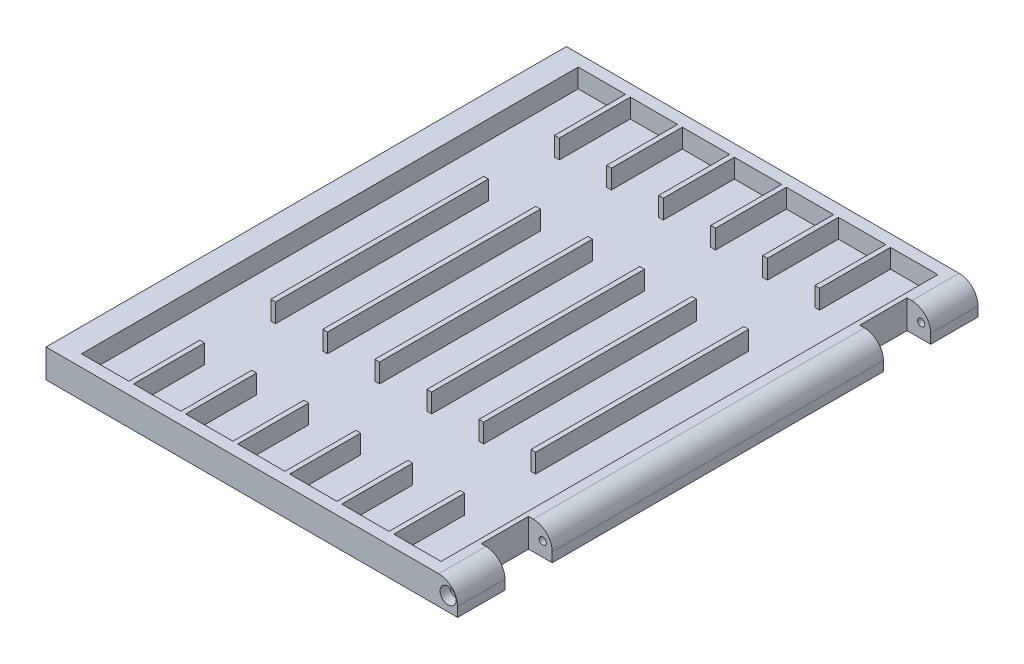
ISO-10303-21;
HEADER;
FILE_DESCRIPTION(('STEP AP214'),'2;1');
FILE_NAME('part.step','',(''),(''),'','','');
FILE_SCHEMA(('AUTOMOTIVE_DESIGN { 1 0 10303 214 1 1 1 1 }'));
ENDSEC;
DATA;
#1=APPLICATION_CONTEXT('core data for automotive mechanical design processes');
#2=APPLICATION_PROTOCOL_DEFINITION('international standard','automotive_design',2000,#1);
#3=PRODUCT_CONTEXT('',#1,'mechanical');
#4=PRODUCT('Part','Part','',(#3));
#5=PRODUCT_RELATED_PRODUCT_CATEGORY('part','',(#4));
#6=PRODUCT_DEFINITION_FORMATION('','',#4);
#7=PRODUCT_DEFINITION_CONTEXT('part definition',#1,'design');
#8=PRODUCT_DEFINITION('design','',#6,#7);
#9=PRODUCT_DEFINITION_SHAPE('','',#8);
#10=(LENGTH_UNIT() NAMED_UNIT(*) SI_UNIT(.MILLI.,.METRE.));
#11=(NAMED_UNIT(*) PLANE_ANGLE_UNIT() SI_UNIT($,.RADIAN.));
#12=(NAMED_UNIT(*) SI_UNIT($,.STERADIAN.) SOLID_ANGLE_UNIT());
#13=UNCERTAINTY_MEASURE_WITH_UNIT(LENGTH_MEASURE(1.E-05),#10,'distance_accuracy_value','');
#14=(GEOMETRIC_REPRESENTATION_CONTEXT(3) GLOBAL_UNCERTAINTY_ASSIGNED_CONTEXT((#13)) GLOBAL_UNIT_ASSIGNED_CONTEXT((#10,
#11,#12)) REPRESENTATION_CONTEXT('',''));
#15=CARTESIAN_POINT('',(0.,0.,0.));
#16=DIRECTION('',(0.,0.,1.));
#17=DIRECTION('',(1.,0.,0.));
#18=AXIS2_PLACEMENT_3D('',#15,#16,#17);
#19=CARTESIAN_POINT('',(82.4979782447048,1.,4.99999999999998));
#20=DIRECTION('',(0.,0.,-1.));
#21=DIRECTION('',(-1.,0.,0.));
#22=AXIS2_PLACEMENT_3D('',#19,#20,#21);
#23=CYLINDRICAL_SURFACE('',#22,0.749999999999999);
#24=CARTESIAN_POINT('',(82.4979782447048,1.,-10.));
#25=DIRECTION('',(0.,0.,1.));
#26=DIRECTION('',(1.,0.,0.));
#27=AXIS2_PLACEMENT_3D('',#24,#25,#26);
#28=CIRCLE('',#27,0.749999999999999);
#29=CARTESIAN_POINT('',(83.2479782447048,1.,-10.));
#30=VERTEX_POINT('',#29);
#31=EDGE_CURVE('E687',#30,#30,#28,.T.);
#32=ORIENTED_EDGE('',*,*,#31,.F.);
#33=EDGE_LOOP('',(#32));
#34=FACE_BOUND('',#33,.T.);
#35=CARTESIAN_POINT('',(82.4979782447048,1.,-2.));
#36=DIRECTION('',(0.,0.,1.));
#37=DIRECTION('',(1.,0.,0.));
#38=AXIS2_PLACEMENT_3D('',#35,#36,#37);
#39=CIRCLE('',#38,0.749999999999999);
#40=CARTESIAN_POINT('',(83.2479782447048,1.,-2.));
#41=VERTEX_POINT('',#40);
#42=EDGE_CURVE('E677',#41,#41,#39,.F.);
#43=ORIENTED_EDGE('',*,*,#42,.F.);
#44=EDGE_LOOP('',(#43));
#45=FACE_BOUND('',#44,.T.);
#46=ADVANCED_FACE('F35',(#34,#45),#23,.F.);
#47=CARTESIAN_POINT('',(82.4979782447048,1.,-100.));
#48=DIRECTION('',(0.,0.,-1.));
#49=DIRECTION('',(-1.,0.,0.));
#50=AXIS2_PLACEMENT_3D('',#47,#48,#49);
#51=CIRCLE('',#50,0.749999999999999);
#52=CARTESIAN_POINT('',(81.7479782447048,1.,-100.));
#53=VERTEX_POINT('',#52);
#54=EDGE_CURVE('E694',#53,#53,#51,.T.);
#55=ORIENTED_EDGE('',*,*,#54,.F.);
#56=EDGE_LOOP('',(#55));
#57=FACE_BOUND('',#56,.T.);
#58=CARTESIAN_POINT('',(82.4979782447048,1.,-108.));
#59=DIRECTION('',(0.,0.,-1.));
#60=DIRECTION('',(-1.,0.,0.));
#61=AXIS2_PLACEMENT_3D('',#58,#59,#60);
#62=CIRCLE('',#61,0.749999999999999);
#63=CARTESIAN_POINT('',(81.7479782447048,1.,-108.));
#64=VERTEX_POINT('',#63);
#65=EDGE_CURVE('E683',#64,#64,#62,.F.);
#66=ORIENTED_EDGE('',*,*,#65,.F.);
#67=EDGE_LOOP('',(#66));
#68=FACE_BOUND('',#67,.T.);
#69=ADVANCED_FACE('F1331',(#57,#68),#23,.F.);
#70=CARTESIAN_POINT('',(84.5004076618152,0.,0.));
#71=DIRECTION('',(1.,0.,0.));
#72=DIRECTION('',(0.,0.,-1.));
#73=AXIS2_PLACEMENT_3D('',#70,#71,#72);
#74=PLANE('',#73);
#75=DIRECTION('',(0.,-1.,0.));
#76=VECTOR('',#75,1.);
#77=CARTESIAN_POINT('',(84.5004076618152,4.,-10.));
#78=LINE('',#77,#76);
#79=CARTESIAN_POINT('',(84.5004076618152,0.,-10.));
#80=VERTEX_POINT('',#79);
#81=CARTESIAN_POINT('',(84.5004076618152,-2.,-10.));
#82=VERTEX_POINT('',#81);
#83=EDGE_CURVE('E712',#80,#82,#78,.T.);
#84=ORIENTED_EDGE('',*,*,#83,.F.);
#85=DIRECTION('',(0.,0.,1.));
#86=VECTOR('',#85,1.);
#87=CARTESIAN_POINT('',(84.5004076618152,0.,0.));
#88=LINE('',#87,#86);
#89=CARTESIAN_POINT('',(84.5004076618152,0.,0.));
#90=VERTEX_POINT('',#89);
#91=EDGE_CURVE('E1252',#80,#90,#88,.T.);
#92=ORIENTED_EDGE('',*,*,#91,.T.);
#93=DIRECTION('',(0.,-1.,0.));
#94=VECTOR('',#93,1.);
#95=CARTESIAN_POINT('',(84.5004076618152,4.,0.));
#96=LINE('',#95,#94);
#97=CARTESIAN_POINT('',(84.5004076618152,-2.,0.));
#98=VERTEX_POINT('',#97);
#99=EDGE_CURVE('E720',#90,#98,#96,.T.);
#100=ORIENTED_EDGE('',*,*,#99,.T.);
#101=DIRECTION('',(0.,0.,-1.));
#102=VECTOR('',#101,1.);
#103=CARTESIAN_POINT('',(84.5004076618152,-2.,0.));
#104=LINE('',#103,#102);
#105=EDGE_CURVE('E755',#98,#82,#104,.T.);
#106=ORIENTED_EDGE('',*,*,#105,.T.);
#107=EDGE_LOOP('',(#84,#92,#100,#106));
#108=FACE_BOUND('',#107,.T.);
#109=ADVANCED_FACE('F1313',(#108),#74,.T.);
#110=DIRECTION('',(0.,1.,0.));
#111=VECTOR('',#110,1.);
#112=CARTESIAN_POINT('',(84.5004076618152,4.,-110.));
#113=LINE('',#112,#111);
#114=CARTESIAN_POINT('',(84.5004076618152,-2.,-110.));
#115=VERTEX_POINT('',#114);
#116=CARTESIAN_POINT('',(84.5004076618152,0.,-110.));
#117=VERTEX_POINT('',#116);
#118=EDGE_CURVE('E758',#115,#117,#113,.T.);
#119=ORIENTED_EDGE('',*,*,#118,.T.);
#120=DIRECTION('',(0.,0.,1.));
#121=VECTOR('',#120,1.);
#122=CARTESIAN_POINT('',(84.5004076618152,0.,-100.));
#123=LINE('',#122,#121);
#124=CARTESIAN_POINT('',(84.5004076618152,0.,-100.));
#125=VERTEX_POINT('',#124);
#126=EDGE_CURVE('E1233',#117,#125,#123,.T.);
#127=ORIENTED_EDGE('',*,*,#126,.T.);
#128=DIRECTION('',(0.,1.,0.));
#129=VECTOR('',#128,1.);
#130=CARTESIAN_POINT('',(84.5004076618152,-2.,-100.));
#131=LINE('',#130,#129);
#132=CARTESIAN_POINT('',(84.5004076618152,-2.,-100.));
#133=VERTEX_POINT('',#132);
#134=EDGE_CURVE('E697',#133,#125,#131,.T.);
#135=ORIENTED_EDGE('',*,*,#134,.F.);
#136=EDGE_CURVE('E754',#133,#115,#104,.T.);
#137=ORIENTED_EDGE('',*,*,#136,.T.);
#138=EDGE_LOOP('',(#119,#127,#135,#137));
#139=FACE_BOUND('',#138,.T.);
#140=ADVANCED_FACE('F1295',(#139),#74,.T.);
#141=CARTESIAN_POINT('',(12.5019589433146,-6.,-107.498714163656));
#142=DIRECTION('',(1.,0.,0.));
#143=DIRECTION('',(0.,0.,-1.));
#144=AXIS2_PLACEMENT_3D('',#141,#142,#143);
#145=PLANE('',#144);
#146=DIRECTION('',(0.,0.,-1.));
#147=VECTOR('',#146,1.);
#148=CARTESIAN_POINT('',(12.5019589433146,0.,-107.498714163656));
#149=LINE('',#148,#147);
#150=CARTESIAN_POINT('',(12.5019589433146,0.,-32.5048509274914));
#151=VERTEX_POINT('',#150);
#152=CARTESIAN_POINT('',(12.5019589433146,0.,-77.4971072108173));
#153=VERTEX_POINT('',#152);
#154=EDGE_CURVE('E1040',#151,#153,#149,.T.);
#155=ORIENTED_EDGE('',*,*,#154,.F.);
#156=DIRECTION('',(0.,1.,0.));
#157=VECTOR('',#156,1.);
#158=CARTESIAN_POINT('',(12.5019589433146,0.,-32.5048509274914));
#159=LINE('',#158,#157);
#160=CARTESIAN_POINT('',(12.5019589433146,4.,-32.5048509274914));
#161=VERTEX_POINT('',#160);
#162=EDGE_CURVE('E788',#151,#161,#159,.T.);
#163=ORIENTED_EDGE('',*,*,#162,.T.);
#164=DIRECTION('',(0.,0.,-1.));
#165=VECTOR('',#164,1.);
#166=CARTESIAN_POINT('',(12.5019589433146,4.,-107.498714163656));
#167=LINE('',#166,#165);
#168=CARTESIAN_POINT('',(12.5019589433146,4.,-77.4971072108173));
#169=VERTEX_POINT('',#168);
#170=EDGE_CURVE('E1151',#161,#169,#167,.T.);
#171=ORIENTED_EDGE('',*,*,#170,.T.);
#172=DIRECTION('',(0.,1.,0.));
#173=VECTOR('',#172,1.);
#174=CARTESIAN_POINT('',(12.5019589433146,0.,-77.4971072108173));
#175=LINE('',#174,#173);
#176=EDGE_CURVE('E807',#153,#169,#175,.T.);
#177=ORIENTED_EDGE('',*,*,#176,.F.);
#178=EDGE_LOOP('',(#155,#163,#171,#177));
#179=FACE_BOUND('',#178,.T.);
#180=ADVANCED_FACE('F1392',(#179),#145,.F.);
#181=CARTESIAN_POINT('',(12.5019589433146,0.,-92.4984477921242));
#182=VERTEX_POINT('',#181);
#183=CARTESIAN_POINT('',(12.5019589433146,0.,-107.498714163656));
#184=VERTEX_POINT('',#183);
#185=EDGE_CURVE('E1034',#182,#184,#149,.T.);
#186=ORIENTED_EDGE('',*,*,#185,.F.);
#187=DIRECTION('',(0.,1.,0.));
#188=VECTOR('',#187,1.);
#189=CARTESIAN_POINT('',(12.5019589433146,0.,-92.4984477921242));
#190=LINE('',#189,#188);
#191=CARTESIAN_POINT('',(12.5019589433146,4.,-92.4984477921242));
#192=VERTEX_POINT('',#191);
#193=EDGE_CURVE('E816',#182,#192,#190,.T.);
#194=ORIENTED_EDGE('',*,*,#193,.T.);
#195=CARTESIAN_POINT('',(12.5019589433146,4.,-107.498714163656));
#196=VERTEX_POINT('',#195);
#197=EDGE_CURVE('E1146',#192,#196,#167,.T.);
#198=ORIENTED_EDGE('',*,*,#197,.T.);
#199=DIRECTION('',(0.,1.,0.));
#200=VECTOR('',#199,1.);
#201=CARTESIAN_POINT('',(12.5019589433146,-6.,-107.498714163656));
#202=LINE('',#201,#200);
#203=EDGE_CURVE('E1227',#184,#196,#202,.T.);
#204=ORIENTED_EDGE('',*,*,#203,.F.);
#205=EDGE_LOOP('',(#186,#194,#198,#204));
#206=FACE_BOUND('',#205,.T.);
#207=ADVANCED_FACE('F1395',(#206),#145,.F.);
#208=CARTESIAN_POINT('',(13.5007659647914,-6.,-107.498714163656));
#209=DIRECTION('',(-1.,0.,0.));
#210=DIRECTION('',(0.,0.,1.));
#211=AXIS2_PLACEMENT_3D('',#208,#209,#210);
#212=PLANE('',#211);
#213=DIRECTION('',(0.,0.,1.));
#214=VECTOR('',#213,1.);
#215=CARTESIAN_POINT('',(13.5007659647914,4.,-107.498714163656));
#216=LINE('',#215,#214);
#217=CARTESIAN_POINT('',(13.5007659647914,4.,-77.4971072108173));
#218=VERTEX_POINT('',#217);
#219=CARTESIAN_POINT('',(13.5007659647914,4.,-32.5048509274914));
#220=VERTEX_POINT('',#219);
#221=EDGE_CURVE('E1132',#218,#220,#216,.T.);
#222=ORIENTED_EDGE('',*,*,#221,.T.);
#223=DIRECTION('',(0.,-1.,0.));
#224=VECTOR('',#223,1.);
#225=CARTESIAN_POINT('',(13.5007659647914,-6.,-32.5048509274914));
#226=LINE('',#225,#224);
#227=CARTESIAN_POINT('',(13.5007659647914,0.,-32.5048509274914));
#228=VERTEX_POINT('',#227);
#229=EDGE_CURVE('E941',#220,#228,#226,.T.);
#230=ORIENTED_EDGE('',*,*,#229,.T.);
#231=DIRECTION('',(0.,0.,1.));
#232=VECTOR('',#231,1.);
#233=CARTESIAN_POINT('',(13.5007659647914,0.,-107.498714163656));
#234=LINE('',#233,#232);
#235=CARTESIAN_POINT('',(13.5007659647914,0.,-77.4971072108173));
#236=VERTEX_POINT('',#235);
#237=EDGE_CURVE('E1035',#236,#228,#234,.T.);
#238=ORIENTED_EDGE('',*,*,#237,.F.);
#239=DIRECTION('',(0.,1.,0.));
#240=VECTOR('',#239,1.);
#241=CARTESIAN_POINT('',(13.5007659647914,-6.,-77.4971072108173));
#242=LINE('',#241,#240);
#243=EDGE_CURVE('E851',#236,#218,#242,.T.);
#244=ORIENTED_EDGE('',*,*,#243,.T.);
#245=EDGE_LOOP('',(#222,#230,#238,#244));
#246=FACE_BOUND('',#245,.T.);
#247=ADVANCED_FACE('F1405',(#246),#212,.F.);
#248=CARTESIAN_POINT('',(13.5007659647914,4.,-107.498714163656));
#249=VERTEX_POINT('',#248);
#250=CARTESIAN_POINT('',(13.5007659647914,4.,-92.4984477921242));
#251=VERTEX_POINT('',#250);
#252=EDGE_CURVE('E1128',#249,#251,#216,.T.);
#253=ORIENTED_EDGE('',*,*,#252,.T.);
#254=DIRECTION('',(0.,-1.,0.));
#255=VECTOR('',#254,1.);
#256=CARTESIAN_POINT('',(13.5007659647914,-6.,-92.4984477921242));
#257=LINE('',#256,#255);
#258=CARTESIAN_POINT('',(13.5007659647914,0.,-92.4984477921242));
#259=VERTEX_POINT('',#258);
#260=EDGE_CURVE('E881',#251,#259,#257,.T.);
#261=ORIENTED_EDGE('',*,*,#260,.T.);
#262=CARTESIAN_POINT('',(13.5007659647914,0.,-107.498714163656));
#263=VERTEX_POINT('',#262);
#264=EDGE_CURVE('E1031',#263,#259,#234,.T.);
#265=ORIENTED_EDGE('',*,*,#264,.F.);
#266=DIRECTION('',(0.,1.,0.));
#267=VECTOR('',#266,1.);
#268=CARTESIAN_POINT('',(13.5007659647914,-6.,-107.498714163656));
#269=LINE('',#268,#267);
#270=EDGE_CURVE('E1212',#263,#249,#269,.T.);
#271=ORIENTED_EDGE('',*,*,#270,.T.);
#272=EDGE_LOOP('',(#253,#261,#265,#271));
#273=FACE_BOUND('',#272,.T.);
#274=ADVANCED_FACE('F1408',(#273),#212,.F.);
#275=CARTESIAN_POINT('',(23.5007659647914,-6.,-107.498714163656));
#276=DIRECTION('',(1.,0.,0.));
#277=DIRECTION('',(0.,0.,-1.));
#278=AXIS2_PLACEMENT_3D('',#275,#276,#277);
#279=PLANE('',#278);
#280=DIRECTION('',(0.,0.,-1.));
#281=VECTOR('',#280,1.);
#282=CARTESIAN_POINT('',(23.5007659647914,0.,-107.498714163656));
#283=LINE('',#282,#281);
#284=CARTESIAN_POINT('',(23.5007659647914,0.,-32.5048509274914));
#285=VERTEX_POINT('',#284);
#286=CARTESIAN_POINT('',(23.5007659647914,0.,-77.4971072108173));
#287=VERTEX_POINT('',#286);
#288=EDGE_CURVE('E1027',#285,#287,#283,.T.);
#289=ORIENTED_EDGE('',*,*,#288,.F.);
#290=DIRECTION('',(0.,1.,0.));
#291=VECTOR('',#290,1.);
#292=CARTESIAN_POINT('',(23.5007659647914,-6.,-32.5048509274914));
#293=LINE('',#292,#291);
#294=CARTESIAN_POINT('',(23.5007659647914,4.,-32.5048509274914));
#295=VERTEX_POINT('',#294);
#296=EDGE_CURVE('E938',#285,#295,#293,.T.);
#297=ORIENTED_EDGE('',*,*,#296,.T.);
#298=DIRECTION('',(0.,0.,-1.));
#299=VECTOR('',#298,1.);
#300=CARTESIAN_POINT('',(23.5007659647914,4.,-107.498714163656));
#301=LINE('',#300,#299);
#302=CARTESIAN_POINT('',(23.5007659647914,4.,-77.4971072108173));
#303=VERTEX_POINT('',#302);
#304=EDGE_CURVE('E1140',#295,#303,#301,.T.);
#305=ORIENTED_EDGE('',*,*,#304,.T.);
#306=DIRECTION('',(0.,-1.,0.));
#307=VECTOR('',#306,1.);
#308=CARTESIAN_POINT('',(23.5007659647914,-6.,-77.4971072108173));
#309=LINE('',#308,#307);
#310=EDGE_CURVE('E848',#303,#287,#309,.T.);
#311=ORIENTED_EDGE('',*,*,#310,.T.);
#312=EDGE_LOOP('',(#289,#297,#305,#311));
#313=FACE_BOUND('',#312,.T.);
#314=ADVANCED_FACE('F1417',(#313),#279,.F.);
#315=CARTESIAN_POINT('',(23.5007659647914,0.,-92.4984477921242));
#316=VERTEX_POINT('',#315);
#317=CARTESIAN_POINT('',(23.5007659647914,0.,-107.498714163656));
#318=VERTEX_POINT('',#317);
#319=EDGE_CURVE('E1022',#316,#318,#283,.T.);
#320=ORIENTED_EDGE('',*,*,#319,.F.);
#321=DIRECTION('',(0.,1.,0.));
#322=VECTOR('',#321,1.);
#323=CARTESIAN_POINT('',(23.5007659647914,-6.,-92.4984477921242));
#324=LINE('',#323,#322);
#325=CARTESIAN_POINT('',(23.5007659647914,4.,-92.4984477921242));
#326=VERTEX_POINT('',#325);
#327=EDGE_CURVE('E878',#316,#326,#324,.T.);
#328=ORIENTED_EDGE('',*,*,#327,.T.);
#329=CARTESIAN_POINT('',(23.5007659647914,4.,-107.498714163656));
#330=VERTEX_POINT('',#329);
#331=EDGE_CURVE('E1135',#326,#330,#301,.T.);
#332=ORIENTED_EDGE('',*,*,#331,.T.);
#333=DIRECTION('',(0.,1.,0.));
#334=VECTOR('',#333,1.);
#335=CARTESIAN_POINT('',(23.5007659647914,-6.,-107.498714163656));
#336=LINE('',#335,#334);
#337=EDGE_CURVE('E1215',#318,#330,#336,.T.);
#338=ORIENTED_EDGE('',*,*,#337,.F.);
#339=EDGE_LOOP('',(#320,#328,#332,#338));
#340=FACE_BOUND('',#339,.T.);
#341=ADVANCED_FACE('F1420',(#340),#279,.F.);
#342=CARTESIAN_POINT('',(24.5040052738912,-6.,-107.498714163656));
#343=DIRECTION('',(-1.,0.,0.));
#344=DIRECTION('',(0.,0.,1.));
#345=AXIS2_PLACEMENT_3D('',#342,#343,#344);
#346=PLANE('',#345);
#347=DIRECTION('',(0.,0.,1.));
#348=VECTOR('',#347,1.);
#349=CARTESIAN_POINT('',(24.5040052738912,4.,-107.498714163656));
#350=LINE('',#349,#348);
#351=CARTESIAN_POINT('',(24.5040052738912,4.,-77.4971072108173));
#352=VERTEX_POINT('',#351);
#353=CARTESIAN_POINT('',(24.5040052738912,4.,-32.5048509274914));
#354=VERTEX_POINT('',#353);
#355=EDGE_CURVE('E1116',#352,#354,#350,.T.);
#356=ORIENTED_EDGE('',*,*,#355,.T.);
#357=DIRECTION('',(0.,-1.,0.));
#358=VECTOR('',#357,1.);
#359=CARTESIAN_POINT('',(24.5040052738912,-6.,-32.5048509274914));
#360=LINE('',#359,#358);
#361=CARTESIAN_POINT('',(24.5040052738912,0.,-32.5048509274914));
#362=VERTEX_POINT('',#361);
#363=EDGE_CURVE('E935',#354,#362,#360,.T.);
#364=ORIENTED_EDGE('',*,*,#363,.T.);
#365=DIRECTION('',(0.,0.,1.));
#366=VECTOR('',#365,1.);
#367=CARTESIAN_POINT('',(24.5040052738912,0.,-107.498714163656));
#368=LINE('',#367,#366);
#369=CARTESIAN_POINT('',(24.5040052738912,0.,-77.4971072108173));
#370=VERTEX_POINT('',#369);
#371=EDGE_CURVE('E1019',#370,#362,#368,.T.);
#372=ORIENTED_EDGE('',*,*,#371,.F.);
#373=DIRECTION('',(0.,1.,0.));
#374=VECTOR('',#373,1.);
#375=CARTESIAN_POINT('',(24.5040052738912,-6.,-77.4971072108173));
#376=LINE('',#375,#374);
#377=EDGE_CURVE('E845',#370,#352,#376,.T.);
#378=ORIENTED_EDGE('',*,*,#377,.T.);
#379=EDGE_LOOP('',(#356,#364,#372,#378));
#380=FACE_BOUND('',#379,.T.);
#381=ADVANCED_FACE('F1426',(#380),#346,.F.);
#382=CARTESIAN_POINT('',(24.5040052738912,4.,-107.498714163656));
#383=VERTEX_POINT('',#382);
#384=CARTESIAN_POINT('',(24.5040052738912,4.,-92.4984477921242));
#385=VERTEX_POINT('',#384);
#386=EDGE_CURVE('E1112',#383,#385,#350,.T.);
#387=ORIENTED_EDGE('',*,*,#386,.T.);
#388=DIRECTION('',(0.,-1.,0.));
#389=VECTOR('',#388,1.);
#390=CARTESIAN_POINT('',(24.5040052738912,-6.,-92.4984477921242));
#391=LINE('',#390,#389);
#392=CARTESIAN_POINT('',(24.5040052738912,0.,-92.4984477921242));
#393=VERTEX_POINT('',#392);
#394=EDGE_CURVE('E875',#385,#393,#391,.T.);
#395=ORIENTED_EDGE('',*,*,#394,.T.);
#396=CARTESIAN_POINT('',(24.5040052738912,0.,-107.498714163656));
#397=VERTEX_POINT('',#396);
#398=EDGE_CURVE('E1015',#397,#393,#368,.T.);
#399=ORIENTED_EDGE('',*,*,#398,.F.);
#400=DIRECTION('',(0.,1.,0.));
#401=VECTOR('',#400,1.);
#402=CARTESIAN_POINT('',(24.5040052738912,-6.,-107.498714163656));
#403=LINE('',#402,#401);
#404=EDGE_CURVE('E1202',#397,#383,#403,.T.);
#405=ORIENTED_EDGE('',*,*,#404,.T.);
#406=EDGE_LOOP('',(#387,#395,#399,#405));
#407=FACE_BOUND('',#406,.T.);
#408=ADVANCED_FACE('F1429',(#407),#346,.F.);
#409=CARTESIAN_POINT('',(34.5040052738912,-6.,-107.498714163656));
#410=DIRECTION('',(1.,0.,0.));
#411=DIRECTION('',(0.,0.,-1.));
#412=AXIS2_PLACEMENT_3D('',#409,#410,#411);
#413=PLANE('',#412);
#414=DIRECTION('',(0.,0.,-1.));
#415=VECTOR('',#414,1.);
#416=CARTESIAN_POINT('',(34.5040052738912,0.,-107.498714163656));
#417=LINE('',#416,#415);
#418=CARTESIAN_POINT('',(34.5040052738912,0.,-32.5048509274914));
#419=VERTEX_POINT('',#418);
#420=CARTESIAN_POINT('',(34.5040052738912,0.,-77.4971072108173));
#421=VERTEX_POINT('',#420);
#422=EDGE_CURVE('E1011',#419,#421,#417,.T.);
#423=ORIENTED_EDGE('',*,*,#422,.F.);
#424=DIRECTION('',(0.,1.,0.));
#425=VECTOR('',#424,1.);
#426=CARTESIAN_POINT('',(34.5040052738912,-6.,-32.5048509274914));
#427=LINE('',#426,#425);
#428=CARTESIAN_POINT('',(34.5040052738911,4.,-32.5048509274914));
#429=VERTEX_POINT('',#428);
#430=EDGE_CURVE('E932',#419,#429,#427,.T.);
#431=ORIENTED_EDGE('',*,*,#430,.T.);
#432=DIRECTION('',(0.,0.,-1.));
#433=VECTOR('',#432,1.);
#434=CARTESIAN_POINT('',(34.5040052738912,4.,-107.498714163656));
#435=LINE('',#434,#433);
#436=CARTESIAN_POINT('',(34.5040052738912,4.,-77.4971072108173));
#437=VERTEX_POINT('',#436);
#438=EDGE_CURVE('E1124',#429,#437,#435,.T.);
#439=ORIENTED_EDGE('',*,*,#438,.T.);
#440=DIRECTION('',(0.,-1.,0.));
#441=VECTOR('',#440,1.);
#442=CARTESIAN_POINT('',(34.5040052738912,-6.,-77.4971072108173));
#443=LINE('',#442,#441);
#444=EDGE_CURVE('E842',#437,#421,#443,.T.);
#445=ORIENTED_EDGE('',*,*,#444,.T.);
#446=EDGE_LOOP('',(#423,#431,#439,#445));
#447=FACE_BOUND('',#446,.T.);
#448=ADVANCED_FACE('F1437',(#447),#413,.F.);
#449=CARTESIAN_POINT('',(34.5040052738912,0.,-92.4984477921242));
#450=VERTEX_POINT('',#449);
#451=CARTESIAN_POINT('',(34.5040052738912,0.,-107.498714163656));
#452=VERTEX_POINT('',#451);
#453=EDGE_CURVE('E1006',#450,#452,#417,.T.);
#454=ORIENTED_EDGE('',*,*,#453,.F.);
#455=DIRECTION('',(0.,1.,0.));
#456=VECTOR('',#455,1.);
#457=CARTESIAN_POINT('',(34.5040052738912,-6.,-92.4984477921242));
#458=LINE('',#457,#456);
#459=CARTESIAN_POINT('',(34.5040052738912,4.,-92.4984477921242));
#460=VERTEX_POINT('',#459);
#461=EDGE_CURVE('E872',#450,#460,#458,.T.);
#462=ORIENTED_EDGE('',*,*,#461,.T.);
#463=CARTESIAN_POINT('',(34.5040052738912,4.,-107.498714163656));
#464=VERTEX_POINT('',#463);
#465=EDGE_CURVE('E1119',#460,#464,#435,.T.);
#466=ORIENTED_EDGE('',*,*,#465,.T.);
#467=DIRECTION('',(0.,1.,0.));
#468=VECTOR('',#467,1.);
#469=CARTESIAN_POINT('',(34.5040052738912,-6.,-107.498714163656));
#470=LINE('',#469,#468);
#471=EDGE_CURVE('E1205',#452,#464,#470,.T.);
#472=ORIENTED_EDGE('',*,*,#471,.F.);
#473=EDGE_LOOP('',(#454,#462,#466,#472));
#474=FACE_BOUND('',#473,.T.);
#475=ADVANCED_FACE('F1440',(#474),#413,.F.);
#476=CARTESIAN_POINT('',(35.5024216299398,-6.,-107.498714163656));
#477=DIRECTION('',(-1.,0.,0.));
#478=DIRECTION('',(0.,0.,1.));
#479=AXIS2_PLACEMENT_3D('',#476,#477,#478);
#480=PLANE('',#479);
#481=DIRECTION('',(0.,0.,1.));
#482=VECTOR('',#481,1.);
#483=CARTESIAN_POINT('',(35.5024216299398,4.,-107.498714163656));
#484=LINE('',#483,#482);
#485=CARTESIAN_POINT('',(35.5024216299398,4.,-77.4971072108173));
#486=VERTEX_POINT('',#485);
#487=CARTESIAN_POINT('',(35.5024216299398,4.,-32.5048509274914));
#488=VERTEX_POINT('',#487);
#489=EDGE_CURVE('E1100',#486,#488,#484,.T.);
#490=ORIENTED_EDGE('',*,*,#489,.T.);
#491=DIRECTION('',(0.,-1.,0.));
#492=VECTOR('',#491,1.);
#493=CARTESIAN_POINT('',(35.5024216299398,-6.,-32.5048509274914));
#494=LINE('',#493,#492);
#495=CARTESIAN_POINT('',(35.5024216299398,0.,-32.5048509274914));
#496=VERTEX_POINT('',#495);
#497=EDGE_CURVE('E929',#488,#496,#494,.T.);
#498=ORIENTED_EDGE('',*,*,#497,.T.);
#499=DIRECTION('',(0.,0.,1.));
#500=VECTOR('',#499,1.);
#501=CARTESIAN_POINT('',(35.5024216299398,0.,-107.498714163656));
#502=LINE('',#501,#500);
#503=CARTESIAN_POINT('',(35.5024216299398,0.,-77.4971072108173));
#504=VERTEX_POINT('',#503);
#505=EDGE_CURVE('E1003',#504,#496,#502,.T.);
#506=ORIENTED_EDGE('',*,*,#505,.F.);
#507=DIRECTION('',(0.,1.,0.));
#508=VECTOR('',#507,1.);
#509=CARTESIAN_POINT('',(35.5024216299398,-6.,-77.4971072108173));
#510=LINE('',#509,#508);
#511=EDGE_CURVE('E839',#504,#486,#510,.T.);
#512=ORIENTED_EDGE('',*,*,#511,.T.);
#513=EDGE_LOOP('',(#490,#498,#506,#512));
#514=FACE_BOUND('',#513,.T.);
#515=ADVANCED_FACE('F1446',(#514),#480,.F.);
#516=CARTESIAN_POINT('',(35.5024216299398,4.,-107.498714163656));
#517=VERTEX_POINT('',#516);
#518=CARTESIAN_POINT('',(35.5024216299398,4.,-92.4984477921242));
#519=VERTEX_POINT('',#518);
#520=EDGE_CURVE('E1096',#517,#519,#484,.T.);
#521=ORIENTED_EDGE('',*,*,#520,.T.);
#522=DIRECTION('',(0.,-1.,0.));
#523=VECTOR('',#522,1.);
#524=CARTESIAN_POINT('',(35.5024216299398,-6.,-92.4984477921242));
#525=LINE('',#524,#523);
#526=CARTESIAN_POINT('',(35.5024216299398,0.,-92.4984477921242));
#527=VERTEX_POINT('',#526);
#528=EDGE_CURVE('E869',#519,#527,#525,.T.);
#529=ORIENTED_EDGE('',*,*,#528,.T.);
#530=CARTESIAN_POINT('',(35.5024216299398,0.,-107.498714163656));
#531=VERTEX_POINT('',#530);
#532=EDGE_CURVE('E999',#531,#527,#502,.T.);
#533=ORIENTED_EDGE('',*,*,#532,.F.);
#534=DIRECTION('',(0.,1.,0.));
#535=VECTOR('',#534,1.);
#536=CARTESIAN_POINT('',(35.5024216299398,-6.,-107.498714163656));
#537=LINE('',#536,#535);
#538=EDGE_CURVE('E1192',#531,#517,#537,.T.);
#539=ORIENTED_EDGE('',*,*,#538,.T.);
#540=EDGE_LOOP('',(#521,#529,#533,#539));
#541=FACE_BOUND('',#540,.T.);
#542=ADVANCED_FACE('F1449',(#541),#480,.F.);
#543=CARTESIAN_POINT('',(45.5024216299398,-6.,-107.498714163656));
#544=DIRECTION('',(1.,0.,0.));
#545=DIRECTION('',(0.,0.,-1.));
#546=AXIS2_PLACEMENT_3D('',#543,#544,#545);
#547=PLANE('',#546);
#548=DIRECTION('',(0.,0.,-1.));
#549=VECTOR('',#548,1.);
#550=CARTESIAN_POINT('',(45.5024216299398,0.,-107.498714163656));
#551=LINE('',#550,#549);
#552=CARTESIAN_POINT('',(45.5024216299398,0.,-32.5048509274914));
#553=VERTEX_POINT('',#552);
#554=CARTESIAN_POINT('',(45.5024216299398,0.,-77.4971072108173));
#555=VERTEX_POINT('',#554);
#556=EDGE_CURVE('E995',#553,#555,#551,.T.);
#557=ORIENTED_EDGE('',*,*,#556,.F.);
#558=DIRECTION('',(0.,1.,0.));
#559=VECTOR('',#558,1.);
#560=CARTESIAN_POINT('',(45.5024216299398,-6.,-32.5048509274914));
#561=LINE('',#560,#559);
#562=CARTESIAN_POINT('',(45.5024216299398,4.,-32.5048509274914));
#563=VERTEX_POINT('',#562);
#564=EDGE_CURVE('E926',#553,#563,#561,.T.);
#565=ORIENTED_EDGE('',*,*,#564,.T.);
#566=DIRECTION('',(0.,0.,-1.));
#567=VECTOR('',#566,1.);
#568=CARTESIAN_POINT('',(45.5024216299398,4.,-107.498714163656));
#569=LINE('',#568,#567);
#570=CARTESIAN_POINT('',(45.5024216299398,4.,-77.4971072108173));
#571=VERTEX_POINT('',#570);
#572=EDGE_CURVE('E1108',#563,#571,#569,.T.);
#573=ORIENTED_EDGE('',*,*,#572,.T.);
#574=DIRECTION('',(0.,-1.,0.));
#575=VECTOR('',#574,1.);
#576=CARTESIAN_POINT('',(45.5024216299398,-6.,-77.4971072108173));
#577=LINE('',#576,#575);
#578=EDGE_CURVE('E836',#571,#555,#577,.T.);
#579=ORIENTED_EDGE('',*,*,#578,.T.);
#580=EDGE_LOOP('',(#557,#565,#573,#579));
#581=FACE_BOUND('',#580,.T.);
#582=ADVANCED_FACE('F1457',(#581),#547,.F.);
#583=CARTESIAN_POINT('',(45.5024216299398,0.,-92.4984477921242));
#584=VERTEX_POINT('',#583);
#585=CARTESIAN_POINT('',(45.5024216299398,0.,-107.498714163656));
#586=VERTEX_POINT('',#585);
#587=EDGE_CURVE('E990',#584,#586,#551,.T.);
#588=ORIENTED_EDGE('',*,*,#587,.F.);
#589=DIRECTION('',(0.,1.,0.));
#590=VECTOR('',#589,1.);
#591=CARTESIAN_POINT('',(45.5024216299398,-6.,-92.4984477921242));
#592=LINE('',#591,#590);
#593=CARTESIAN_POINT('',(45.5024216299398,4.,-92.4984477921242));
#594=VERTEX_POINT('',#593);
#595=EDGE_CURVE('E866',#584,#594,#592,.T.);
#596=ORIENTED_EDGE('',*,*,#595,.T.);
#597=CARTESIAN_POINT('',(45.5024216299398,4.,-107.498714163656));
#598=VERTEX_POINT('',#597);
#599=EDGE_CURVE('E1103',#594,#598,#569,.T.);
#600=ORIENTED_EDGE('',*,*,#599,.T.);
#601=DIRECTION('',(0.,1.,0.));
#602=VECTOR('',#601,1.);
#603=CARTESIAN_POINT('',(45.5024216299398,-6.,-107.498714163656));
#604=LINE('',#603,#602);
#605=EDGE_CURVE('E1195',#586,#598,#604,.T.);
#606=ORIENTED_EDGE('',*,*,#605,.F.);
#607=EDGE_LOOP('',(#588,#596,#600,#606));
#608=FACE_BOUND('',#607,.T.);
#609=ADVANCED_FACE('F1460',(#608),#547,.F.);
#610=CARTESIAN_POINT('',(46.5020442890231,-6.,-107.498714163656));
#611=DIRECTION('',(-1.,0.,0.));
#612=DIRECTION('',(0.,0.,1.));
#613=AXIS2_PLACEMENT_3D('',#610,#611,#612);
#614=PLANE('',#613);
#615=DIRECTION('',(0.,0.,1.));
#616=VECTOR('',#615,1.);
#617=CARTESIAN_POINT('',(46.5020442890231,4.,-107.498714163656));
#618=LINE('',#617,#616);
#619=CARTESIAN_POINT('',(46.5020442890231,4.,-77.4971072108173));
#620=VERTEX_POINT('',#619);
#621=CARTESIAN_POINT('',(46.5020442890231,4.,-32.5048509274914));
#622=VERTEX_POINT('',#621);
#623=EDGE_CURVE('E1084',#620,#622,#618,.T.);
#624=ORIENTED_EDGE('',*,*,#623,.T.);
#625=DIRECTION('',(0.,-1.,0.));
#626=VECTOR('',#625,1.);
#627=CARTESIAN_POINT('',(46.5020442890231,-6.,-32.5048509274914));
#628=LINE('',#627,#626);
#629=CARTESIAN_POINT('',(46.5020442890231,0.,-32.5048509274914));
#630=VERTEX_POINT('',#629);
#631=EDGE_CURVE('E923',#622,#630,#628,.T.);
#632=ORIENTED_EDGE('',*,*,#631,.T.);
#633=DIRECTION('',(0.,0.,1.));
#634=VECTOR('',#633,1.);
#635=CARTESIAN_POINT('',(46.5020442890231,0.,-107.498714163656));
#636=LINE('',#635,#634);
#637=CARTESIAN_POINT('',(46.5020442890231,0.,-77.4971072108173));
#638=VERTEX_POINT('',#637);
#639=EDGE_CURVE('E987',#638,#630,#636,.T.);
#640=ORIENTED_EDGE('',*,*,#639,.F.);
#641=DIRECTION('',(0.,1.,0.));
#642=VECTOR('',#641,1.);
#643=CARTESIAN_POINT('',(46.5020442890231,-6.,-77.4971072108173));
#644=LINE('',#643,#642);
#645=EDGE_CURVE('E833',#638,#620,#644,.T.);
#646=ORIENTED_EDGE('',*,*,#645,.T.);
#647=EDGE_LOOP('',(#624,#632,#640,#646));
#648=FACE_BOUND('',#647,.T.);
#649=ADVANCED_FACE('F1466',(#648),#614,.F.);
#650=CARTESIAN_POINT('',(46.5020442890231,4.,-107.498714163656));
#651=VERTEX_POINT('',#650);
#652=CARTESIAN_POINT('',(46.5020442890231,4.,-92.4984477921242));
#653=VERTEX_POINT('',#652);
#654=EDGE_CURVE('E1080',#651,#653,#618,.T.);
#655=ORIENTED_EDGE('',*,*,#654,.T.);
#656=DIRECTION('',(0.,-1.,0.));
#657=VECTOR('',#656,1.);
#658=CARTESIAN_POINT('',(46.5020442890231,-6.,-92.4984477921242));
#659=LINE('',#658,#657);
#660=CARTESIAN_POINT('',(46.5020442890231,0.,-92.4984477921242));
#661=VERTEX_POINT('',#660);
#662=EDGE_CURVE('E863',#653,#661,#659,.T.);
#663=ORIENTED_EDGE('',*,*,#662,.T.);
#664=CARTESIAN_POINT('',(46.5020442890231,0.,-107.498714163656));
#665=VERTEX_POINT('',#664);
#666=EDGE_CURVE('E983',#665,#661,#636,.T.);
#667=ORIENTED_EDGE('',*,*,#666,.F.);
#668=DIRECTION('',(0.,1.,0.));
#669=VECTOR('',#668,1.);
#670=CARTESIAN_POINT('',(46.5020442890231,-6.,-107.498714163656));
#671=LINE('',#670,#669);
#672=EDGE_CURVE('E1182',#665,#651,#671,.T.);
#673=ORIENTED_EDGE('',*,*,#672,.T.);
#674=EDGE_LOOP('',(#655,#663,#667,#673));
#675=FACE_BOUND('',#674,.T.);
#676=ADVANCED_FACE('F1469',(#675),#614,.F.);
#677=CARTESIAN_POINT('',(56.502041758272,-6.,-107.498714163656));
#678=DIRECTION('',(1.,0.,0.));
#679=DIRECTION('',(0.,0.,-1.));
#680=AXIS2_PLACEMENT_3D('',#677,#678,#679);
#681=PLANE('',#680);
#682=DIRECTION('',(0.,0.,-1.));
#683=VECTOR('',#682,1.);
#684=CARTESIAN_POINT('',(56.502041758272,0.,-107.498714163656));
#685=LINE('',#684,#683);
#686=CARTESIAN_POINT('',(56.502041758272,0.,-32.5048509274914));
#687=VERTEX_POINT('',#686);
#688=CARTESIAN_POINT('',(56.502041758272,0.,-77.4971072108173));
#689=VERTEX_POINT('',#688);
#690=EDGE_CURVE('E979',#687,#689,#685,.T.);
#691=ORIENTED_EDGE('',*,*,#690,.F.);
#692=DIRECTION('',(0.,1.,0.));
#693=VECTOR('',#692,1.);
#694=CARTESIAN_POINT('',(56.502041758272,-6.,-32.5048509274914));
#695=LINE('',#694,#693);
#696=CARTESIAN_POINT('',(56.502041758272,4.,-32.5048509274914));
#697=VERTEX_POINT('',#696);
#698=EDGE_CURVE('E920',#687,#697,#695,.T.);
#699=ORIENTED_EDGE('',*,*,#698,.T.);
#700=DIRECTION('',(0.,0.,-1.));
#701=VECTOR('',#700,1.);
#702=CARTESIAN_POINT('',(56.502041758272,4.,-107.498714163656));
#703=LINE('',#702,#701);
#704=CARTESIAN_POINT('',(56.502041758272,4.,-77.4971072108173));
#705=VERTEX_POINT('',#704);
#706=EDGE_CURVE('E1092',#697,#705,#703,.T.);
#707=ORIENTED_EDGE('',*,*,#706,.T.);
#708=DIRECTION('',(0.,-1.,0.));
#709=VECTOR('',#708,1.);
#710=CARTESIAN_POINT('',(56.502041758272,-6.,-77.4971072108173));
#711=LINE('',#710,#709);
#712=EDGE_CURVE('E830',#705,#689,#711,.T.);
#713=ORIENTED_EDGE('',*,*,#712,.T.);
#714=EDGE_LOOP('',(#691,#699,#707,#713));
#715=FACE_BOUND('',#714,.T.);
#716=ADVANCED_FACE('F1477',(#715),#681,.F.);
#717=CARTESIAN_POINT('',(56.502041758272,0.,-92.4984477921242));
#718=VERTEX_POINT('',#717);
#719=CARTESIAN_POINT('',(56.502041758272,0.,-107.498714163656));
#720=VERTEX_POINT('',#719);
#721=EDGE_CURVE('E974',#718,#720,#685,.T.);
#722=ORIENTED_EDGE('',*,*,#721,.F.);
#723=DIRECTION('',(0.,1.,0.));
#724=VECTOR('',#723,1.);
#725=CARTESIAN_POINT('',(56.502041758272,-6.,-92.4984477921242));
#726=LINE('',#725,#724);
#727=CARTESIAN_POINT('',(56.502041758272,4.,-92.4984477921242));
#728=VERTEX_POINT('',#727);
#729=EDGE_CURVE('E860',#718,#728,#726,.T.);
#730=ORIENTED_EDGE('',*,*,#729,.T.);
#731=CARTESIAN_POINT('',(56.502041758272,4.,-107.498714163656));
#732=VERTEX_POINT('',#731);
#733=EDGE_CURVE('E1087',#728,#732,#703,.T.);
#734=ORIENTED_EDGE('',*,*,#733,.T.);
#735=DIRECTION('',(0.,1.,0.));
#736=VECTOR('',#735,1.);
#737=CARTESIAN_POINT('',(56.502041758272,-6.,-107.498714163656));
#738=LINE('',#737,#736);
#739=EDGE_CURVE('E1185',#720,#732,#738,.T.);
#740=ORIENTED_EDGE('',*,*,#739,.F.);
#741=EDGE_LOOP('',(#722,#730,#734,#740));
#742=FACE_BOUND('',#741,.T.);
#743=ADVANCED_FACE('F1480',(#742),#681,.F.);
#744=CARTESIAN_POINT('',(57.5008487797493,-6.,-107.498714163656));
#745=DIRECTION('',(-1.,0.,0.));
#746=DIRECTION('',(0.,0.,1.));
#747=AXIS2_PLACEMENT_3D('',#744,#745,#746);
#748=PLANE('',#747);
#749=DIRECTION('',(0.,0.,1.));
#750=VECTOR('',#749,1.);
#751=CARTESIAN_POINT('',(57.5008487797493,4.,-107.498714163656));
#752=LINE('',#751,#750);
#753=CARTESIAN_POINT('',(57.5008487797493,4.,-77.4971072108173));
#754=VERTEX_POINT('',#753);
#755=CARTESIAN_POINT('',(57.5008487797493,4.,-32.5048509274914));
#756=VERTEX_POINT('',#755);
#757=EDGE_CURVE('E1068',#754,#756,#752,.T.);
#758=ORIENTED_EDGE('',*,*,#757,.T.);
#759=DIRECTION('',(0.,-1.,0.));
#760=VECTOR('',#759,1.);
#761=CARTESIAN_POINT('',(57.5008487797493,-6.,-32.5048509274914));
#762=LINE('',#761,#760);
#763=CARTESIAN_POINT('',(57.5008487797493,0.,-32.5048509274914));
#764=VERTEX_POINT('',#763);
#765=EDGE_CURVE('E917',#756,#764,#762,.T.);
#766=ORIENTED_EDGE('',*,*,#765,.T.);
#767=DIRECTION('',(0.,0.,1.));
#768=VECTOR('',#767,1.);
#769=CARTESIAN_POINT('',(57.5008487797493,0.,-107.498714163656));
#770=LINE('',#769,#768);
#771=CARTESIAN_POINT('',(57.5008487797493,0.,-77.4971072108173));
#772=VERTEX_POINT('',#771);
#773=EDGE_CURVE('E971',#772,#764,#770,.T.);
#774=ORIENTED_EDGE('',*,*,#773,.F.);
#775=DIRECTION('',(0.,1.,0.));
#776=VECTOR('',#775,1.);
#777=CARTESIAN_POINT('',(57.5008487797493,-6.,-77.4971072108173));
#778=LINE('',#777,#776);
#779=EDGE_CURVE('E827',#772,#754,#778,.T.);
#780=ORIENTED_EDGE('',*,*,#779,.T.);
#781=EDGE_LOOP('',(#758,#766,#774,#780));
#782=FACE_BOUND('',#781,.T.);
#783=ADVANCED_FACE('F1486',(#782),#748,.F.);
#784=CARTESIAN_POINT('',(57.5008487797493,4.,-107.498714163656));
#785=VERTEX_POINT('',#784);
#786=CARTESIAN_POINT('',(57.5008487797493,4.,-92.4984477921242));
#787=VERTEX_POINT('',#786);
#788=EDGE_CURVE('E1064',#785,#787,#752,.T.);
#789=ORIENTED_EDGE('',*,*,#788,.T.);
#790=DIRECTION('',(0.,-1.,0.));
#791=VECTOR('',#790,1.);
#792=CARTESIAN_POINT('',(57.5008487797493,-6.,-92.4984477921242));
#793=LINE('',#792,#791);
#794=CARTESIAN_POINT('',(57.5008487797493,0.,-92.4984477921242));
#795=VERTEX_POINT('',#794);
#796=EDGE_CURVE('E857',#787,#795,#793,.T.);
#797=ORIENTED_EDGE('',*,*,#796,.T.);
#798=CARTESIAN_POINT('',(57.5008487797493,0.,-107.498714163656));
#799=VERTEX_POINT('',#798);
#800=EDGE_CURVE('E967',#799,#795,#770,.T.);
#801=ORIENTED_EDGE('',*,*,#800,.F.);
#802=DIRECTION('',(0.,1.,0.));
#803=VECTOR('',#802,1.);
#804=CARTESIAN_POINT('',(57.5008487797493,-6.,-107.498714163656));
#805=LINE('',#804,#803);
#806=EDGE_CURVE('E1172',#799,#785,#805,.T.);
#807=ORIENTED_EDGE('',*,*,#806,.T.);
#808=EDGE_LOOP('',(#789,#797,#801,#807));
#809=FACE_BOUND('',#808,.T.);
#810=ADVANCED_FACE('F1489',(#809),#748,.F.);
#811=CARTESIAN_POINT('',(67.5008487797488,-6.,-107.498714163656));
#812=DIRECTION('',(1.,0.,0.));
#813=DIRECTION('',(0.,0.,-1.));
#814=AXIS2_PLACEMENT_3D('',#811,#812,#813);
#815=PLANE('',#814);
#816=DIRECTION('',(0.,0.,-1.));
#817=VECTOR('',#816,1.);
#818=CARTESIAN_POINT('',(67.5008487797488,0.,-107.498714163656));
#819=LINE('',#818,#817);
#820=CARTESIAN_POINT('',(67.5008487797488,0.,-32.5048509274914));
#821=VERTEX_POINT('',#820);
#822=CARTESIAN_POINT('',(67.5008487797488,0.,-77.4971072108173));
#823=VERTEX_POINT('',#822);
#824=EDGE_CURVE('E963',#821,#823,#819,.T.);
#825=ORIENTED_EDGE('',*,*,#824,.F.);
#826=DIRECTION('',(0.,1.,0.));
#827=VECTOR('',#826,1.);
#828=CARTESIAN_POINT('',(67.5008487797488,-6.,-32.5048509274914));
#829=LINE('',#828,#827);
#830=CARTESIAN_POINT('',(67.5008487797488,4.,-32.5048509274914));
#831=VERTEX_POINT('',#830);
#832=EDGE_CURVE('E914',#821,#831,#829,.T.);
#833=ORIENTED_EDGE('',*,*,#832,.T.);
#834=DIRECTION('',(0.,0.,-1.));
#835=VECTOR('',#834,1.);
#836=CARTESIAN_POINT('',(67.5008487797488,4.,-107.498714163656));
#837=LINE('',#836,#835);
#838=CARTESIAN_POINT('',(67.5008487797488,4.,-77.4971072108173));
#839=VERTEX_POINT('',#838);
#840=EDGE_CURVE('E1076',#831,#839,#837,.T.);
#841=ORIENTED_EDGE('',*,*,#840,.T.);
#842=DIRECTION('',(0.,-1.,0.));
#843=VECTOR('',#842,1.);
#844=CARTESIAN_POINT('',(67.5008487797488,-6.,-77.4971072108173));
#845=LINE('',#844,#843);
#846=EDGE_CURVE('E791',#839,#823,#845,.T.);
#847=ORIENTED_EDGE('',*,*,#846,.T.);
#848=EDGE_LOOP('',(#825,#833,#841,#847));
#849=FACE_BOUND('',#848,.T.);
#850=ADVANCED_FACE('F1497',(#849),#815,.F.);
#851=CARTESIAN_POINT('',(67.5008487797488,0.,-92.4984477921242));
#852=VERTEX_POINT('',#851);
#853=CARTESIAN_POINT('',(67.5008487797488,0.,-107.498714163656));
#854=VERTEX_POINT('',#853);
#855=EDGE_CURVE('E958',#852,#854,#819,.T.);
#856=ORIENTED_EDGE('',*,*,#855,.F.);
#857=DIRECTION('',(0.,1.,0.));
#858=VECTOR('',#857,1.);
#859=CARTESIAN_POINT('',(67.5008487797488,-6.,-92.4984477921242));
#860=LINE('',#859,#858);
#861=CARTESIAN_POINT('',(67.5008487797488,4.,-92.4984477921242));
#862=VERTEX_POINT('',#861);
#863=EDGE_CURVE('E854',#852,#862,#860,.T.);
#864=ORIENTED_EDGE('',*,*,#863,.T.);
#865=CARTESIAN_POINT('',(67.5008487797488,4.,-107.498714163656));
#866=VERTEX_POINT('',#865);
#867=EDGE_CURVE('E1071',#862,#866,#837,.T.);
#868=ORIENTED_EDGE('',*,*,#867,.T.);
#869=DIRECTION('',(0.,1.,0.));
#870=VECTOR('',#869,1.);
#871=CARTESIAN_POINT('',(67.5008487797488,-6.,-107.498714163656));
#872=LINE('',#871,#870);
#873=EDGE_CURVE('E1175',#854,#866,#872,.T.);
#874=ORIENTED_EDGE('',*,*,#873,.F.);
#875=EDGE_LOOP('',(#856,#864,#868,#874));
#876=FACE_BOUND('',#875,.T.);
#877=ADVANCED_FACE('F1500',(#876),#815,.F.);
#878=CARTESIAN_POINT('',(68.5040880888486,-6.,-107.498714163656));
#879=DIRECTION('',(-1.,0.,0.));
#880=DIRECTION('',(0.,0.,1.));
#881=AXIS2_PLACEMENT_3D('',#878,#879,#880);
#882=PLANE('',#881);
#883=DIRECTION('',(0.,0.,1.));
#884=VECTOR('',#883,1.);
#885=CARTESIAN_POINT('',(68.5040880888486,4.,-107.498714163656));
#886=LINE('',#885,#884);
#887=CARTESIAN_POINT('',(68.5040880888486,4.,-77.4971072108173));
#888=VERTEX_POINT('',#887);
#889=CARTESIAN_POINT('',(68.5040880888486,4.,-32.5048509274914));
#890=VERTEX_POINT('',#889);
#891=EDGE_CURVE('E1054',#888,#890,#886,.T.);
#892=ORIENTED_EDGE('',*,*,#891,.T.);
#893=DIRECTION('',(0.,1.,0.));
#894=VECTOR('',#893,1.);
#895=CARTESIAN_POINT('',(68.5040880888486,0.,-32.5048509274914));
#896=LINE('',#895,#894);
#897=CARTESIAN_POINT('',(68.5040880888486,0.,-32.5048509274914));
#898=VERTEX_POINT('',#897);
#899=EDGE_CURVE('E792',#898,#890,#896,.T.);
#900=ORIENTED_EDGE('',*,*,#899,.F.);
#901=DIRECTION('',(0.,0.,1.));
#902=VECTOR('',#901,1.);
#903=CARTESIAN_POINT('',(68.5040880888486,0.,-107.498714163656));
#904=LINE('',#903,#902);
#905=CARTESIAN_POINT('',(68.5040880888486,0.,-77.4971072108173));
#906=VERTEX_POINT('',#905);
#907=EDGE_CURVE('E955',#906,#898,#904,.T.);
#908=ORIENTED_EDGE('',*,*,#907,.F.);
#909=DIRECTION('',(0.,1.,0.));
#910=VECTOR('',#909,1.);
#911=CARTESIAN_POINT('',(68.5040880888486,0.,-77.4971072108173));
#912=LINE('',#911,#910);
#913=EDGE_CURVE('E821',#906,#888,#912,.T.);
#914=ORIENTED_EDGE('',*,*,#913,.T.);
#915=EDGE_LOOP('',(#892,#900,#908,#914));
#916=FACE_BOUND('',#915,.T.);
#917=ADVANCED_FACE('F1506',(#916),#882,.F.);
#918=CARTESIAN_POINT('',(68.5040880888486,4.,-107.498714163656));
#919=VERTEX_POINT('',#918);
#920=CARTESIAN_POINT('',(68.5040880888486,4.,-92.4984477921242));
#921=VERTEX_POINT('',#920);
#922=EDGE_CURVE('E1050',#919,#921,#886,.T.);
#923=ORIENTED_EDGE('',*,*,#922,.T.);
#924=DIRECTION('',(0.,1.,0.));
#925=VECTOR('',#924,1.);
#926=CARTESIAN_POINT('',(68.5040880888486,0.,-92.4984477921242));
#927=LINE('',#926,#925);
#928=CARTESIAN_POINT('',(68.5040880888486,0.,-92.4984477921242));
#929=VERTEX_POINT('',#928);
#930=EDGE_CURVE('E819',#929,#921,#927,.T.);
#931=ORIENTED_EDGE('',*,*,#930,.F.);
#932=CARTESIAN_POINT('',(68.5040880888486,0.,-107.498714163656));
#933=VERTEX_POINT('',#932);
#934=EDGE_CURVE('E951',#933,#929,#904,.T.);
#935=ORIENTED_EDGE('',*,*,#934,.F.);
#936=DIRECTION('',(0.,1.,0.));
#937=VECTOR('',#936,1.);
#938=CARTESIAN_POINT('',(68.5040880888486,-6.,-107.498714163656));
#939=LINE('',#938,#937);
#940=EDGE_CURVE('E1163',#933,#919,#939,.T.);
#941=ORIENTED_EDGE('',*,*,#940,.T.);
#942=EDGE_LOOP('',(#923,#931,#935,#941));
#943=FACE_BOUND('',#942,.T.);
#944=ADVANCED_FACE('F1509',(#943),#882,.F.);
#945=CARTESIAN_POINT('',(0.,4.,0.));
#946=DIRECTION('',(0.,-1.,0.));
#947=DIRECTION('',(0.,0.,-1.));
#948=AXIS2_PLACEMENT_3D('',#945,#946,#947);
#949=PLANE('',#948);
#950=ORIENTED_EDGE('',*,*,#840,.F.);
#951=DIRECTION('',(-1.,0.,0.));
#952=VECTOR('',#951,1.);
#953=CARTESIAN_POINT('',(12.5019589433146,4.,-32.5048509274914));
#954=LINE('',#953,#952);
#955=EDGE_CURVE('E785',#890,#831,#954,.T.);
#956=ORIENTED_EDGE('',*,*,#955,.F.);
#957=ORIENTED_EDGE('',*,*,#891,.F.);
#958=DIRECTION('',(1.,0.,0.));
#959=VECTOR('',#958,1.);
#960=CARTESIAN_POINT('',(12.5019589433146,4.,-77.4971072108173));
#961=LINE('',#960,#959);
#962=EDGE_CURVE('E768',#839,#888,#961,.T.);
#963=ORIENTED_EDGE('',*,*,#962,.F.);
#964=EDGE_LOOP('',(#950,#956,#957,#963));
#965=FACE_BOUND('',#964,.T.);
#966=ADVANCED_FACE('F1525',(#965),#949,.F.);
#967=ORIENTED_EDGE('',*,*,#706,.F.);
#968=EDGE_CURVE('E787',#756,#697,#954,.T.);
#969=ORIENTED_EDGE('',*,*,#968,.F.);
#970=ORIENTED_EDGE('',*,*,#757,.F.);
#971=EDGE_CURVE('E2427',#705,#754,#961,.T.);
#972=ORIENTED_EDGE('',*,*,#971,.F.);
#973=EDGE_LOOP('',(#967,#969,#970,#972));
#974=FACE_BOUND('',#973,.T.);
#975=ADVANCED_FACE('F2025',(#974),#949,.F.);
#976=ORIENTED_EDGE('',*,*,#572,.F.);
#977=EDGE_CURVE('E2475',#622,#563,#954,.T.);
#978=ORIENTED_EDGE('',*,*,#977,.F.);
#979=ORIENTED_EDGE('',*,*,#623,.F.);
#980=EDGE_CURVE('E2428',#571,#620,#961,.T.);
#981=ORIENTED_EDGE('',*,*,#980,.F.);
#982=EDGE_LOOP('',(#976,#978,#979,#981));
#983=FACE_BOUND('',#982,.T.);
#984=ADVANCED_FACE('F2016',(#983),#949,.F.);
#985=ORIENTED_EDGE('',*,*,#438,.F.);
#986=EDGE_CURVE('E2474',#488,#429,#954,.T.);
#987=ORIENTED_EDGE('',*,*,#986,.F.);
#988=ORIENTED_EDGE('',*,*,#489,.F.);
#989=EDGE_CURVE('E2429',#437,#486,#961,.T.);
#990=ORIENTED_EDGE('',*,*,#989,.F.);
#991=EDGE_LOOP('',(#985,#987,#988,#990));
#992=FACE_BOUND('',#991,.T.);
#993=ADVANCED_FACE('F2007',(#992),#949,.F.);
#994=ORIENTED_EDGE('',*,*,#304,.F.);
#995=EDGE_CURVE('E2473',#354,#295,#954,.T.);
#996=ORIENTED_EDGE('',*,*,#995,.F.);
#997=ORIENTED_EDGE('',*,*,#355,.F.);
#998=EDGE_CURVE('E812',#303,#352,#961,.T.);
#999=ORIENTED_EDGE('',*,*,#998,.F.);
#1000=EDGE_LOOP('',(#994,#996,#997,#999));
#1001=FACE_BOUND('',#1000,.T.);
#1002=ADVANCED_FACE('F1998',(#1001),#949,.F.);
#1003=ORIENTED_EDGE('',*,*,#170,.F.);
#1004=EDGE_CURVE('E782',#220,#161,#954,.T.);
#1005=ORIENTED_EDGE('',*,*,#1004,.F.);
#1006=ORIENTED_EDGE('',*,*,#221,.F.);
#1007=EDGE_CURVE('E809',#169,#218,#961,.T.);
#1008=ORIENTED_EDGE('',*,*,#1007,.F.);
#1009=EDGE_LOOP('',(#1003,#1005,#1006,#1008));
#1010=FACE_BOUND('',#1009,.T.);
#1011=ADVANCED_FACE('F1390',(#1010),#949,.F.);
#1012=CARTESIAN_POINT('',(2.50195894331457,-6.,-2.50195451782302));
#1013=DIRECTION('',(0.,0.,1.));
#1014=DIRECTION('',(1.,0.,0.));
#1015=AXIS2_PLACEMENT_3D('',#1012,#1013,#1014);
#1016=PLANE('',#1015);
#1017=DIRECTION('',(1.,0.,0.));
#1018=VECTOR('',#1017,1.);
#1019=CARTESIAN_POINT('',(2.50195894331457,0.,-2.50195451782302));
#1020=LINE('',#1019,#1018);
#1021=CARTESIAN_POINT('',(2.50195894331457,0.,-2.50195451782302));
#1022=VERTEX_POINT('',#1021);
#1023=CARTESIAN_POINT('',(12.5019589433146,0.,-2.50195451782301));
#1024=VERTEX_POINT('',#1023);
#1025=EDGE_CURVE('E1046',#1022,#1024,#1020,.T.);
#1026=ORIENTED_EDGE('',*,*,#1025,.F.);
#1027=DIRECTION('',(0.,1.,0.));
#1028=VECTOR('',#1027,1.);
#1029=CARTESIAN_POINT('',(2.50195894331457,-6.,-2.50195451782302));
#1030=LINE('',#1029,#1028);
#1031=CARTESIAN_POINT('',(2.50195894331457,4.,-2.50195451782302));
#1032=VERTEX_POINT('',#1031);
#1033=EDGE_CURVE('E1222',#1022,#1032,#1030,.T.);
#1034=ORIENTED_EDGE('',*,*,#1033,.T.);
#1035=DIRECTION('',(1.,0.,0.));
#1036=VECTOR('',#1035,1.);
#1037=CARTESIAN_POINT('',(2.50195894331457,4.,-2.50195451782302));
#1038=LINE('',#1037,#1036);
#1039=CARTESIAN_POINT('',(12.5019589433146,4.,-2.50195451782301));
#1040=VERTEX_POINT('',#1039);
#1041=EDGE_CURVE('E1143',#1032,#1040,#1038,.T.);
#1042=ORIENTED_EDGE('',*,*,#1041,.T.);
#1043=DIRECTION('',(0.,1.,0.));
#1044=VECTOR('',#1043,1.);
#1045=CARTESIAN_POINT('',(12.5019589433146,-6.,-2.50195451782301));
#1046=LINE('',#1045,#1044);
#1047=EDGE_CURVE('E1214',#1024,#1040,#1046,.T.);
#1048=ORIENTED_EDGE('',*,*,#1047,.F.);
#1049=EDGE_LOOP('',(#1026,#1034,#1042,#1048));
#1050=FACE_BOUND('',#1049,.T.);
#1051=ADVANCED_FACE('F1386',(#1050),#1016,.F.);
#1052=CARTESIAN_POINT('',(2.50195894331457,-6.,-107.498714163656));
#1053=DIRECTION('',(-1.,0.,0.));
#1054=DIRECTION('',(0.,0.,1.));
#1055=AXIS2_PLACEMENT_3D('',#1052,#1053,#1054);
#1056=PLANE('',#1055);
#1057=DIRECTION('',(0.,0.,1.));
#1058=VECTOR('',#1057,1.);
#1059=CARTESIAN_POINT('',(2.50195894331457,0.,-107.498714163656));
#1060=LINE('',#1059,#1058);
#1061=CARTESIAN_POINT('',(2.50195894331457,0.,-107.498714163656));
#1062=VERTEX_POINT('',#1061);
#1063=EDGE_CURVE('E1043',#1062,#1022,#1060,.T.);
#1064=ORIENTED_EDGE('',*,*,#1063,.F.);
#1065=DIRECTION('',(0.,1.,0.));
#1066=VECTOR('',#1065,1.);
#1067=CARTESIAN_POINT('',(2.50195894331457,-6.,-107.498714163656));
#1068=LINE('',#1067,#1066);
#1069=CARTESIAN_POINT('',(2.50195894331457,4.,-107.498714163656));
#1070=VERTEX_POINT('',#1069);
#1071=EDGE_CURVE('E1225',#1062,#1070,#1068,.T.);
#1072=ORIENTED_EDGE('',*,*,#1071,.T.);
#1073=DIRECTION('',(0.,0.,1.));
#1074=VECTOR('',#1073,1.);
#1075=CARTESIAN_POINT('',(2.50195894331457,4.,-107.498714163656));
#1076=LINE('',#1075,#1074);
#1077=EDGE_CURVE('E1154',#1070,#1032,#1076,.T.);
#1078=ORIENTED_EDGE('',*,*,#1077,.T.);
#1079=ORIENTED_EDGE('',*,*,#1033,.F.);
#1080=EDGE_LOOP('',(#1064,#1072,#1078,#1079));
#1081=FACE_BOUND('',#1080,.T.);
#1082=ADVANCED_FACE('F1389',(#1081),#1056,.F.);
#1083=CARTESIAN_POINT('',(2.50195894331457,-6.,-107.498714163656));
#1084=DIRECTION('',(0.,0.,-1.));
#1085=DIRECTION('',(-1.,0.,0.));
#1086=AXIS2_PLACEMENT_3D('',#1083,#1084,#1085);
#1087=PLANE('',#1086);
#1088=DIRECTION('',(-1.,0.,0.));
#1089=VECTOR('',#1088,1.);
#1090=CARTESIAN_POINT('',(2.50195894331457,0.,-107.498714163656));
#1091=LINE('',#1090,#1089);
#1092=EDGE_CURVE('E1039',#184,#1062,#1091,.T.);
#1093=ORIENTED_EDGE('',*,*,#1092,.F.);
#1094=ORIENTED_EDGE('',*,*,#203,.T.);
#1095=DIRECTION('',(-1.,0.,0.));
#1096=VECTOR('',#1095,1.);
#1097=CARTESIAN_POINT('',(2.50195894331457,4.,-107.498714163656));
#1098=LINE('',#1097,#1096);
#1099=EDGE_CURVE('E1150',#196,#1070,#1098,.T.);
#1100=ORIENTED_EDGE('',*,*,#1099,.T.);
#1101=ORIENTED_EDGE('',*,*,#1071,.F.);
#1102=EDGE_LOOP('',(#1093,#1094,#1100,#1101));
#1103=FACE_BOUND('',#1102,.T.);
#1104=ADVANCED_FACE('F1398',(#1103),#1087,.F.);
#1105=CARTESIAN_POINT('',(12.5019589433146,4.,-17.5050959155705));
#1106=VERTEX_POINT('',#1105);
#1107=EDGE_CURVE('E1147',#1040,#1106,#167,.T.);
#1108=ORIENTED_EDGE('',*,*,#1107,.T.);
#1109=DIRECTION('',(0.,1.,0.));
#1110=VECTOR('',#1109,1.);
#1111=CARTESIAN_POINT('',(12.5019589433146,0.,-17.5050959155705));
#1112=LINE('',#1111,#1110);
#1113=CARTESIAN_POINT('',(12.5019589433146,0.,-17.5050959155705));
#1114=VERTEX_POINT('',#1113);
#1115=EDGE_CURVE('E778',#1114,#1106,#1112,.T.);
#1116=ORIENTED_EDGE('',*,*,#1115,.F.);
#1117=EDGE_CURVE('E1036',#1024,#1114,#149,.T.);
#1118=ORIENTED_EDGE('',*,*,#1117,.F.);
#1119=ORIENTED_EDGE('',*,*,#1047,.T.);
#1120=EDGE_LOOP('',(#1108,#1116,#1118,#1119));
#1121=FACE_BOUND('',#1120,.T.);
#1122=ADVANCED_FACE('F1397',(#1121),#145,.F.);
#1123=CARTESIAN_POINT('',(13.5007659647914,0.,-17.5050959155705));
#1124=VERTEX_POINT('',#1123);
#1125=CARTESIAN_POINT('',(13.5007659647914,0.,-2.50195451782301));
#1126=VERTEX_POINT('',#1125);
#1127=EDGE_CURVE('E1030',#1124,#1126,#234,.T.);
#1128=ORIENTED_EDGE('',*,*,#1127,.F.);
#1129=DIRECTION('',(0.,1.,0.));
#1130=VECTOR('',#1129,1.);
#1131=CARTESIAN_POINT('',(13.5007659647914,-6.,-17.5050959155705));
#1132=LINE('',#1131,#1130);
#1133=CARTESIAN_POINT('',(13.5007659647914,4.,-17.5050959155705));
#1134=VERTEX_POINT('',#1133);
#1135=EDGE_CURVE('E911',#1124,#1134,#1132,.T.);
#1136=ORIENTED_EDGE('',*,*,#1135,.T.);
#1137=CARTESIAN_POINT('',(13.5007659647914,4.,-2.50195451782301));
#1138=VERTEX_POINT('',#1137);
#1139=EDGE_CURVE('E1127',#1134,#1138,#216,.T.);
#1140=ORIENTED_EDGE('',*,*,#1139,.T.);
#1141=DIRECTION('',(0.,1.,0.));
#1142=VECTOR('',#1141,1.);
#1143=CARTESIAN_POINT('',(13.5007659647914,-6.,-2.50195451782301));
#1144=LINE('',#1143,#1142);
#1145=EDGE_CURVE('E1204',#1126,#1138,#1144,.T.);
#1146=ORIENTED_EDGE('',*,*,#1145,.F.);
#1147=EDGE_LOOP('',(#1128,#1136,#1140,#1146));
#1148=FACE_BOUND('',#1147,.T.);
#1149=ADVANCED_FACE('F1410',(#1148),#212,.F.);
#1150=CARTESIAN_POINT('',(13.5007659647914,-6.,-107.498714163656));
#1151=DIRECTION('',(0.,0.,-1.));
#1152=DIRECTION('',(-1.,0.,0.));
#1153=AXIS2_PLACEMENT_3D('',#1150,#1151,#1152);
#1154=PLANE('',#1153);
#1155=DIRECTION('',(-1.,0.,0.));
#1156=VECTOR('',#1155,1.);
#1157=CARTESIAN_POINT('',(13.5007659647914,0.,-107.498714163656));
#1158=LINE('',#1157,#1156);
#1159=EDGE_CURVE('E1026',#318,#263,#1158,.T.);
#1160=ORIENTED_EDGE('',*,*,#1159,.F.);
#1161=ORIENTED_EDGE('',*,*,#337,.T.);
#1162=DIRECTION('',(-1.,0.,0.));
#1163=VECTOR('',#1162,1.);
#1164=CARTESIAN_POINT('',(13.5007659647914,4.,-107.498714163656));
#1165=LINE('',#1164,#1163);
#1166=EDGE_CURVE('E1139',#330,#249,#1165,.T.);
#1167=ORIENTED_EDGE('',*,*,#1166,.T.);
#1168=ORIENTED_EDGE('',*,*,#270,.F.);
#1169=EDGE_LOOP('',(#1160,#1161,#1167,#1168));
#1170=FACE_BOUND('',#1169,.T.);
#1171=ADVANCED_FACE('F1422',(#1170),#1154,.F.);
#1172=CARTESIAN_POINT('',(23.5007659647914,4.,-2.50195451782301));
#1173=VERTEX_POINT('',#1172);
#1174=CARTESIAN_POINT('',(23.5007659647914,4.,-17.5050959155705));
#1175=VERTEX_POINT('',#1174);
#1176=EDGE_CURVE('E1136',#1173,#1175,#301,.T.);
#1177=ORIENTED_EDGE('',*,*,#1176,.T.);
#1178=DIRECTION('',(0.,-1.,0.));
#1179=VECTOR('',#1178,1.);
#1180=CARTESIAN_POINT('',(23.5007659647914,-6.,-17.5050959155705));
#1181=LINE('',#1180,#1179);
#1182=CARTESIAN_POINT('',(23.5007659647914,0.,-17.5050959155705));
#1183=VERTEX_POINT('',#1182);
#1184=EDGE_CURVE('E908',#1175,#1183,#1181,.T.);
#1185=ORIENTED_EDGE('',*,*,#1184,.T.);
#1186=CARTESIAN_POINT('',(23.5007659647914,0.,-2.50195451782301));
#1187=VERTEX_POINT('',#1186);
#1188=EDGE_CURVE('E1023',#1187,#1183,#283,.T.);
#1189=ORIENTED_EDGE('',*,*,#1188,.F.);
#1190=DIRECTION('',(0.,1.,0.));
#1191=VECTOR('',#1190,1.);
#1192=CARTESIAN_POINT('',(23.5007659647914,-6.,-2.50195451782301));
#1193=LINE('',#1192,#1191);
#1194=EDGE_CURVE('E1218',#1187,#1173,#1193,.T.);
#1195=ORIENTED_EDGE('',*,*,#1194,.T.);
#1196=EDGE_LOOP('',(#1177,#1185,#1189,#1195));
#1197=FACE_BOUND('',#1196,.T.);
#1198=ADVANCED_FACE('F1415',(#1197),#279,.F.);
#1199=CARTESIAN_POINT('',(13.5007659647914,-6.,-2.50195451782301));
#1200=DIRECTION('',(0.,0.,1.));
#1201=DIRECTION('',(1.,0.,0.));
#1202=AXIS2_PLACEMENT_3D('',#1199,#1200,#1201);
#1203=PLANE('',#1202);
#1204=DIRECTION('',(1.,0.,0.));
#1205=VECTOR('',#1204,1.);
#1206=CARTESIAN_POINT('',(13.5007659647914,0.,-2.50195451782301));
#1207=LINE('',#1206,#1205);
#1208=EDGE_CURVE('E1018',#1126,#1187,#1207,.T.);
#1209=ORIENTED_EDGE('',*,*,#1208,.F.);
#1210=ORIENTED_EDGE('',*,*,#1145,.T.);
#1211=DIRECTION('',(1.,0.,0.));
#1212=VECTOR('',#1211,1.);
#1213=CARTESIAN_POINT('',(13.5007659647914,4.,-2.50195451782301));
#1214=LINE('',#1213,#1212);
#1215=EDGE_CURVE('E1131',#1138,#1173,#1214,.T.);
#1216=ORIENTED_EDGE('',*,*,#1215,.T.);
#1217=ORIENTED_EDGE('',*,*,#1194,.F.);
#1218=EDGE_LOOP('',(#1209,#1210,#1216,#1217));
#1219=FACE_BOUND('',#1218,.T.);
#1220=ADVANCED_FACE('F1411',(#1219),#1203,.F.);
#1221=CARTESIAN_POINT('',(24.5040052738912,0.,-17.5050959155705));
#1222=VERTEX_POINT('',#1221);
#1223=CARTESIAN_POINT('',(24.5040052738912,0.,-2.50195451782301));
#1224=VERTEX_POINT('',#1223);
#1225=EDGE_CURVE('E1014',#1222,#1224,#368,.T.);
#1226=ORIENTED_EDGE('',*,*,#1225,.F.);
#1227=DIRECTION('',(0.,1.,0.));
#1228=VECTOR('',#1227,1.);
#1229=CARTESIAN_POINT('',(24.5040052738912,-6.,-17.5050959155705));
#1230=LINE('',#1229,#1228);
#1231=CARTESIAN_POINT('',(24.5040052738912,4.,-17.5050959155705));
#1232=VERTEX_POINT('',#1231);
#1233=EDGE_CURVE('E905',#1222,#1232,#1230,.T.);
#1234=ORIENTED_EDGE('',*,*,#1233,.T.);
#1235=CARTESIAN_POINT('',(24.5040052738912,4.,-2.50195451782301));
#1236=VERTEX_POINT('',#1235);
#1237=EDGE_CURVE('E1111',#1232,#1236,#350,.T.);
#1238=ORIENTED_EDGE('',*,*,#1237,.T.);
#1239=DIRECTION('',(0.,1.,0.));
#1240=VECTOR('',#1239,1.);
#1241=CARTESIAN_POINT('',(24.5040052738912,-6.,-2.50195451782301));
#1242=LINE('',#1241,#1240);
#1243=EDGE_CURVE('E1194',#1224,#1236,#1242,.T.);
#1244=ORIENTED_EDGE('',*,*,#1243,.F.);
#1245=EDGE_LOOP('',(#1226,#1234,#1238,#1244));
#1246=FACE_BOUND('',#1245,.T.);
#1247=ADVANCED_FACE('F1414',(#1246),#346,.F.);
#1248=CARTESIAN_POINT('',(24.5040052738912,-6.,-107.498714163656));
#1249=DIRECTION('',(0.,0.,-1.));
#1250=DIRECTION('',(-1.,0.,0.));
#1251=AXIS2_PLACEMENT_3D('',#1248,#1249,#1250);
#1252=PLANE('',#1251);
#1253=DIRECTION('',(-1.,0.,0.));
#1254=VECTOR('',#1253,1.);
#1255=CARTESIAN_POINT('',(24.5040052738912,0.,-107.498714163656));
#1256=LINE('',#1255,#1254);
#1257=EDGE_CURVE('E1010',#452,#397,#1256,.T.);
#1258=ORIENTED_EDGE('',*,*,#1257,.F.);
#1259=ORIENTED_EDGE('',*,*,#471,.T.);
#1260=DIRECTION('',(-1.,0.,0.));
#1261=VECTOR('',#1260,1.);
#1262=CARTESIAN_POINT('',(24.5040052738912,4.,-107.498714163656));
#1263=LINE('',#1262,#1261);
#1264=EDGE_CURVE('E1123',#464,#383,#1263,.T.);
#1265=ORIENTED_EDGE('',*,*,#1264,.T.);
#1266=ORIENTED_EDGE('',*,*,#404,.F.);
#1267=EDGE_LOOP('',(#1258,#1259,#1265,#1266));
#1268=FACE_BOUND('',#1267,.T.);
#1269=ADVANCED_FACE('F1442',(#1268),#1252,.F.);
#1270=CARTESIAN_POINT('',(34.5040052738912,4.,-2.50195451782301));
#1271=VERTEX_POINT('',#1270);
#1272=CARTESIAN_POINT('',(34.5040052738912,4.,-17.5050959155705));
#1273=VERTEX_POINT('',#1272);
#1274=EDGE_CURVE('E1120',#1271,#1273,#435,.T.);
#1275=ORIENTED_EDGE('',*,*,#1274,.T.);
#1276=DIRECTION('',(0.,-1.,0.));
#1277=VECTOR('',#1276,1.);
#1278=CARTESIAN_POINT('',(34.5040052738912,-6.,-17.5050959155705));
#1279=LINE('',#1278,#1277);
#1280=CARTESIAN_POINT('',(34.5040052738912,0.,-17.5050959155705));
#1281=VERTEX_POINT('',#1280);
#1282=EDGE_CURVE('E902',#1273,#1281,#1279,.T.);
#1283=ORIENTED_EDGE('',*,*,#1282,.T.);
#1284=CARTESIAN_POINT('',(34.5040052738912,0.,-2.50195451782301));
#1285=VERTEX_POINT('',#1284);
#1286=EDGE_CURVE('E1007',#1285,#1281,#417,.T.);
#1287=ORIENTED_EDGE('',*,*,#1286,.F.);
#1288=DIRECTION('',(0.,1.,0.));
#1289=VECTOR('',#1288,1.);
#1290=CARTESIAN_POINT('',(34.5040052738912,-6.,-2.50195451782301));
#1291=LINE('',#1290,#1289);
#1292=EDGE_CURVE('E1208',#1285,#1271,#1291,.T.);
#1293=ORIENTED_EDGE('',*,*,#1292,.T.);
#1294=EDGE_LOOP('',(#1275,#1283,#1287,#1293));
#1295=FACE_BOUND('',#1294,.T.);
#1296=ADVANCED_FACE('F1435',(#1295),#413,.F.);
#1297=CARTESIAN_POINT('',(24.5040052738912,-6.,-2.50195451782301));
#1298=DIRECTION('',(0.,0.,1.));
#1299=DIRECTION('',(1.,0.,0.));
#1300=AXIS2_PLACEMENT_3D('',#1297,#1298,#1299);
#1301=PLANE('',#1300);
#1302=DIRECTION('',(1.,0.,0.));
#1303=VECTOR('',#1302,1.);
#1304=CARTESIAN_POINT('',(24.5040052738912,0.,-2.50195451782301));
#1305=LINE('',#1304,#1303);
#1306=EDGE_CURVE('E1002',#1224,#1285,#1305,.T.);
#1307=ORIENTED_EDGE('',*,*,#1306,.F.);
#1308=ORIENTED_EDGE('',*,*,#1243,.T.);
#1309=DIRECTION('',(1.,0.,0.));
#1310=VECTOR('',#1309,1.);
#1311=CARTESIAN_POINT('',(24.5040052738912,4.,-2.50195451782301));
#1312=LINE('',#1311,#1310);
#1313=EDGE_CURVE('E1115',#1236,#1271,#1312,.T.);
#1314=ORIENTED_EDGE('',*,*,#1313,.T.);
#1315=ORIENTED_EDGE('',*,*,#1292,.F.);
#1316=EDGE_LOOP('',(#1307,#1308,#1314,#1315));
#1317=FACE_BOUND('',#1316,.T.);
#1318=ADVANCED_FACE('F1431',(#1317),#1301,.F.);
#1319=CARTESIAN_POINT('',(35.5024216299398,0.,-17.5050959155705));
#1320=VERTEX_POINT('',#1319);
#1321=CARTESIAN_POINT('',(35.5024216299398,0.,-2.50195451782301));
#1322=VERTEX_POINT('',#1321);
#1323=EDGE_CURVE('E998',#1320,#1322,#502,.T.);
#1324=ORIENTED_EDGE('',*,*,#1323,.F.);
#1325=DIRECTION('',(0.,1.,0.));
#1326=VECTOR('',#1325,1.);
#1327=CARTESIAN_POINT('',(35.5024216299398,-6.,-17.5050959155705));
#1328=LINE('',#1327,#1326);
#1329=CARTESIAN_POINT('',(35.5024216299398,4.,-17.5050959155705));
#1330=VERTEX_POINT('',#1329);
#1331=EDGE_CURVE('E899',#1320,#1330,#1328,.T.);
#1332=ORIENTED_EDGE('',*,*,#1331,.T.);
#1333=CARTESIAN_POINT('',(35.5024216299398,4.,-2.50195451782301));
#1334=VERTEX_POINT('',#1333);
#1335=EDGE_CURVE('E1095',#1330,#1334,#484,.T.);
#1336=ORIENTED_EDGE('',*,*,#1335,.T.);
#1337=DIRECTION('',(0.,1.,0.));
#1338=VECTOR('',#1337,1.);
#1339=CARTESIAN_POINT('',(35.5024216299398,-6.,-2.50195451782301));
#1340=LINE('',#1339,#1338);
#1341=EDGE_CURVE('E1184',#1322,#1334,#1340,.T.);
#1342=ORIENTED_EDGE('',*,*,#1341,.F.);
#1343=EDGE_LOOP('',(#1324,#1332,#1336,#1342));
#1344=FACE_BOUND('',#1343,.T.);
#1345=ADVANCED_FACE('F1434',(#1344),#480,.F.);
#1346=CARTESIAN_POINT('',(35.5024216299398,-6.,-107.498714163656));
#1347=DIRECTION('',(0.,0.,-1.));
#1348=DIRECTION('',(-1.,0.,0.));
#1349=AXIS2_PLACEMENT_3D('',#1346,#1347,#1348);
#1350=PLANE('',#1349);
#1351=DIRECTION('',(-1.,0.,0.));
#1352=VECTOR('',#1351,1.);
#1353=CARTESIAN_POINT('',(35.5024216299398,0.,-107.498714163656));
#1354=LINE('',#1353,#1352);
#1355=EDGE_CURVE('E994',#586,#531,#1354,.T.);
#1356=ORIENTED_EDGE('',*,*,#1355,.F.);
#1357=ORIENTED_EDGE('',*,*,#605,.T.);
#1358=DIRECTION('',(-1.,0.,0.));
#1359=VECTOR('',#1358,1.);
#1360=CARTESIAN_POINT('',(35.5024216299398,4.,-107.498714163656));
#1361=LINE('',#1360,#1359);
#1362=EDGE_CURVE('E1107',#598,#517,#1361,.T.);
#1363=ORIENTED_EDGE('',*,*,#1362,.T.);
#1364=ORIENTED_EDGE('',*,*,#538,.F.);
#1365=EDGE_LOOP('',(#1356,#1357,#1363,#1364));
#1366=FACE_BOUND('',#1365,.T.);
#1367=ADVANCED_FACE('F1462',(#1366),#1350,.F.);
#1368=CARTESIAN_POINT('',(45.5024216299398,4.,-2.50195451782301));
#1369=VERTEX_POINT('',#1368);
#1370=CARTESIAN_POINT('',(45.5024216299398,4.,-17.5050959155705));
#1371=VERTEX_POINT('',#1370);
#1372=EDGE_CURVE('E1104',#1369,#1371,#569,.T.);
#1373=ORIENTED_EDGE('',*,*,#1372,.T.);
#1374=DIRECTION('',(0.,-1.,0.));
#1375=VECTOR('',#1374,1.);
#1376=CARTESIAN_POINT('',(45.5024216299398,-6.,-17.5050959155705));
#1377=LINE('',#1376,#1375);
#1378=CARTESIAN_POINT('',(45.5024216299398,0.,-17.5050959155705));
#1379=VERTEX_POINT('',#1378);
#1380=EDGE_CURVE('E896',#1371,#1379,#1377,.T.);
#1381=ORIENTED_EDGE('',*,*,#1380,.T.);
#1382=CARTESIAN_POINT('',(45.5024216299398,0.,-2.50195451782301));
#1383=VERTEX_POINT('',#1382);
#1384=EDGE_CURVE('E991',#1383,#1379,#551,.T.);
#1385=ORIENTED_EDGE('',*,*,#1384,.F.);
#1386=DIRECTION('',(0.,1.,0.));
#1387=VECTOR('',#1386,1.);
#1388=CARTESIAN_POINT('',(45.5024216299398,-6.,-2.50195451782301));
#1389=LINE('',#1388,#1387);
#1390=EDGE_CURVE('E1198',#1383,#1369,#1389,.T.);
#1391=ORIENTED_EDGE('',*,*,#1390,.T.);
#1392=EDGE_LOOP('',(#1373,#1381,#1385,#1391));
#1393=FACE_BOUND('',#1392,.T.);
#1394=ADVANCED_FACE('F1455',(#1393),#547,.F.);
#1395=CARTESIAN_POINT('',(35.5024216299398,-6.,-2.50195451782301));
#1396=DIRECTION('',(0.,0.,1.));
#1397=DIRECTION('',(1.,0.,0.));
#1398=AXIS2_PLACEMENT_3D('',#1395,#1396,#1397);
#1399=PLANE('',#1398);
#1400=DIRECTION('',(1.,0.,0.));
#1401=VECTOR('',#1400,1.);
#1402=CARTESIAN_POINT('',(35.5024216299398,0.,-2.50195451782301));
#1403=LINE('',#1402,#1401);
#1404=EDGE_CURVE('E986',#1322,#1383,#1403,.T.);
#1405=ORIENTED_EDGE('',*,*,#1404,.F.);
#1406=ORIENTED_EDGE('',*,*,#1341,.T.);
#1407=DIRECTION('',(1.,0.,0.));
#1408=VECTOR('',#1407,1.);
#1409=CARTESIAN_POINT('',(35.5024216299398,4.,-2.50195451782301));
#1410=LINE('',#1409,#1408);
#1411=EDGE_CURVE('E1099',#1334,#1369,#1410,.T.);
#1412=ORIENTED_EDGE('',*,*,#1411,.T.);
#1413=ORIENTED_EDGE('',*,*,#1390,.F.);
#1414=EDGE_LOOP('',(#1405,#1406,#1412,#1413));
#1415=FACE_BOUND('',#1414,.T.);
#1416=ADVANCED_FACE('F1451',(#1415),#1399,.F.);
#1417=CARTESIAN_POINT('',(46.5020442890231,0.,-17.5050959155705));
#1418=VERTEX_POINT('',#1417);
#1419=CARTESIAN_POINT('',(46.5020442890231,0.,-2.50195451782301));
#1420=VERTEX_POINT('',#1419);
#1421=EDGE_CURVE('E982',#1418,#1420,#636,.T.);
#1422=ORIENTED_EDGE('',*,*,#1421,.F.);
#1423=DIRECTION('',(0.,1.,0.));
#1424=VECTOR('',#1423,1.);
#1425=CARTESIAN_POINT('',(46.5020442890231,-6.,-17.5050959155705));
#1426=LINE('',#1425,#1424);
#1427=CARTESIAN_POINT('',(46.5020442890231,4.,-17.5050959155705));
#1428=VERTEX_POINT('',#1427);
#1429=EDGE_CURVE('E893',#1418,#1428,#1426,.T.);
#1430=ORIENTED_EDGE('',*,*,#1429,.T.);
#1431=CARTESIAN_POINT('',(46.5020442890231,4.,-2.50195451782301));
#1432=VERTEX_POINT('',#1431);
#1433=EDGE_CURVE('E1079',#1428,#1432,#618,.T.);
#1434=ORIENTED_EDGE('',*,*,#1433,.T.);
#1435=DIRECTION('',(0.,1.,0.));
#1436=VECTOR('',#1435,1.);
#1437=CARTESIAN_POINT('',(46.5020442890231,-6.,-2.50195451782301));
#1438=LINE('',#1437,#1436);
#1439=EDGE_CURVE('E1174',#1420,#1432,#1438,.T.);
#1440=ORIENTED_EDGE('',*,*,#1439,.F.);
#1441=EDGE_LOOP('',(#1422,#1430,#1434,#1440));
#1442=FACE_BOUND('',#1441,.T.);
#1443=ADVANCED_FACE('F1454',(#1442),#614,.F.);
#1444=CARTESIAN_POINT('',(46.5020442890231,-6.,-107.498714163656));
#1445=DIRECTION('',(0.,0.,-1.));
#1446=DIRECTION('',(-1.,0.,0.));
#1447=AXIS2_PLACEMENT_3D('',#1444,#1445,#1446);
#1448=PLANE('',#1447);
#1449=DIRECTION('',(-1.,0.,0.));
#1450=VECTOR('',#1449,1.);
#1451=CARTESIAN_POINT('',(46.5020442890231,0.,-107.498714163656));
#1452=LINE('',#1451,#1450);
#1453=EDGE_CURVE('E978',#720,#665,#1452,.T.);
#1454=ORIENTED_EDGE('',*,*,#1453,.F.);
#1455=ORIENTED_EDGE('',*,*,#739,.T.);
#1456=DIRECTION('',(-1.,0.,0.));
#1457=VECTOR('',#1456,1.);
#1458=CARTESIAN_POINT('',(46.5020442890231,4.,-107.498714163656));
#1459=LINE('',#1458,#1457);
#1460=EDGE_CURVE('E1091',#732,#651,#1459,.T.);
#1461=ORIENTED_EDGE('',*,*,#1460,.T.);
#1462=ORIENTED_EDGE('',*,*,#672,.F.);
#1463=EDGE_LOOP('',(#1454,#1455,#1461,#1462));
#1464=FACE_BOUND('',#1463,.T.);
#1465=ADVANCED_FACE('F1482',(#1464),#1448,.F.);
#1466=CARTESIAN_POINT('',(56.502041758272,4.,-2.50195451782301));
#1467=VERTEX_POINT('',#1466);
#1468=CARTESIAN_POINT('',(56.502041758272,4.,-17.5050959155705));
#1469=VERTEX_POINT('',#1468);
#1470=EDGE_CURVE('E1088',#1467,#1469,#703,.T.);
#1471=ORIENTED_EDGE('',*,*,#1470,.T.);
#1472=DIRECTION('',(0.,-1.,0.));
#1473=VECTOR('',#1472,1.);
#1474=CARTESIAN_POINT('',(56.502041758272,-6.,-17.5050959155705));
#1475=LINE('',#1474,#1473);
#1476=CARTESIAN_POINT('',(56.502041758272,0.,-17.5050959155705));
#1477=VERTEX_POINT('',#1476);
#1478=EDGE_CURVE('E890',#1469,#1477,#1475,.T.);
#1479=ORIENTED_EDGE('',*,*,#1478,.T.);
#1480=CARTESIAN_POINT('',(56.502041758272,0.,-2.50195451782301));
#1481=VERTEX_POINT('',#1480);
#1482=EDGE_CURVE('E975',#1481,#1477,#685,.T.);
#1483=ORIENTED_EDGE('',*,*,#1482,.F.);
#1484=DIRECTION('',(0.,1.,0.));
#1485=VECTOR('',#1484,1.);
#1486=CARTESIAN_POINT('',(56.502041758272,-6.,-2.50195451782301));
#1487=LINE('',#1486,#1485);
#1488=EDGE_CURVE('E1188',#1481,#1467,#1487,.T.);
#1489=ORIENTED_EDGE('',*,*,#1488,.T.);
#1490=EDGE_LOOP('',(#1471,#1479,#1483,#1489));
#1491=FACE_BOUND('',#1490,.T.);
#1492=ADVANCED_FACE('F1475',(#1491),#681,.F.);
#1493=CARTESIAN_POINT('',(46.5020442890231,-6.,-2.50195451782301));
#1494=DIRECTION('',(0.,0.,1.));
#1495=DIRECTION('',(1.,0.,0.));
#1496=AXIS2_PLACEMENT_3D('',#1493,#1494,#1495);
#1497=PLANE('',#1496);
#1498=DIRECTION('',(1.,0.,0.));
#1499=VECTOR('',#1498,1.);
#1500=CARTESIAN_POINT('',(46.5020442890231,0.,-2.50195451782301));
#1501=LINE('',#1500,#1499);
#1502=EDGE_CURVE('E970',#1420,#1481,#1501,.T.);
#1503=ORIENTED_EDGE('',*,*,#1502,.F.);
#1504=ORIENTED_EDGE('',*,*,#1439,.T.);
#1505=DIRECTION('',(1.,0.,0.));
#1506=VECTOR('',#1505,1.);
#1507=CARTESIAN_POINT('',(46.5020442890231,4.,-2.50195451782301));
#1508=LINE('',#1507,#1506);
#1509=EDGE_CURVE('E1083',#1432,#1467,#1508,.T.);
#1510=ORIENTED_EDGE('',*,*,#1509,.T.);
#1511=ORIENTED_EDGE('',*,*,#1488,.F.);
#1512=EDGE_LOOP('',(#1503,#1504,#1510,#1511));
#1513=FACE_BOUND('',#1512,.T.);
#1514=ADVANCED_FACE('F1471',(#1513),#1497,.F.);
#1515=CARTESIAN_POINT('',(57.5008487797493,0.,-17.5050959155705));
#1516=VERTEX_POINT('',#1515);
#1517=CARTESIAN_POINT('',(57.5008487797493,0.,-2.50195451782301));
#1518=VERTEX_POINT('',#1517);
#1519=EDGE_CURVE('E966',#1516,#1518,#770,.T.);
#1520=ORIENTED_EDGE('',*,*,#1519,.F.);
#1521=DIRECTION('',(0.,1.,0.));
#1522=VECTOR('',#1521,1.);
#1523=CARTESIAN_POINT('',(57.5008487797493,-6.,-17.5050959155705));
#1524=LINE('',#1523,#1522);
#1525=CARTESIAN_POINT('',(57.5008487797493,4.,-17.5050959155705));
#1526=VERTEX_POINT('',#1525);
#1527=EDGE_CURVE('E887',#1516,#1526,#1524,.T.);
#1528=ORIENTED_EDGE('',*,*,#1527,.T.);
#1529=CARTESIAN_POINT('',(57.5008487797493,4.,-2.50195451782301));
#1530=VERTEX_POINT('',#1529);
#1531=EDGE_CURVE('E1063',#1526,#1530,#752,.T.);
#1532=ORIENTED_EDGE('',*,*,#1531,.T.);
#1533=DIRECTION('',(0.,1.,0.));
#1534=VECTOR('',#1533,1.);
#1535=CARTESIAN_POINT('',(57.5008487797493,-6.,-2.50195451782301));
#1536=LINE('',#1535,#1534);
#1537=EDGE_CURVE('E1165',#1518,#1530,#1536,.T.);
#1538=ORIENTED_EDGE('',*,*,#1537,.F.);
#1539=EDGE_LOOP('',(#1520,#1528,#1532,#1538));
#1540=FACE_BOUND('',#1539,.T.);
#1541=ADVANCED_FACE('F1474',(#1540),#748,.F.);
#1542=CARTESIAN_POINT('',(57.5008487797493,-6.,-107.498714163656));
#1543=DIRECTION('',(0.,0.,-1.));
#1544=DIRECTION('',(-1.,0.,0.));
#1545=AXIS2_PLACEMENT_3D('',#1542,#1543,#1544);
#1546=PLANE('',#1545);
#1547=DIRECTION('',(-1.,0.,0.));
#1548=VECTOR('',#1547,1.);
#1549=CARTESIAN_POINT('',(57.5008487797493,0.,-107.498714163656));
#1550=LINE('',#1549,#1548);
#1551=EDGE_CURVE('E962',#854,#799,#1550,.T.);
#1552=ORIENTED_EDGE('',*,*,#1551,.F.);
#1553=ORIENTED_EDGE('',*,*,#873,.T.);
#1554=DIRECTION('',(-1.,0.,0.));
#1555=VECTOR('',#1554,1.);
#1556=CARTESIAN_POINT('',(57.5008487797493,4.,-107.498714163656));
#1557=LINE('',#1556,#1555);
#1558=EDGE_CURVE('E1075',#866,#785,#1557,.T.);
#1559=ORIENTED_EDGE('',*,*,#1558,.T.);
#1560=ORIENTED_EDGE('',*,*,#806,.F.);
#1561=EDGE_LOOP('',(#1552,#1553,#1559,#1560));
#1562=FACE_BOUND('',#1561,.T.);
#1563=ADVANCED_FACE('F1502',(#1562),#1546,.F.);
#1564=CARTESIAN_POINT('',(67.5008487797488,4.,-2.50195451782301));
#1565=VERTEX_POINT('',#1564);
#1566=CARTESIAN_POINT('',(67.5008487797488,4.,-17.5050959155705));
#1567=VERTEX_POINT('',#1566);
#1568=EDGE_CURVE('E1072',#1565,#1567,#837,.T.);
#1569=ORIENTED_EDGE('',*,*,#1568,.T.);
#1570=DIRECTION('',(0.,-1.,0.));
#1571=VECTOR('',#1570,1.);
#1572=CARTESIAN_POINT('',(67.5008487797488,-6.,-17.5050959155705));
#1573=LINE('',#1572,#1571);
#1574=CARTESIAN_POINT('',(67.5008487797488,0.,-17.5050959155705));
#1575=VERTEX_POINT('',#1574);
#1576=EDGE_CURVE('E884',#1567,#1575,#1573,.T.);
#1577=ORIENTED_EDGE('',*,*,#1576,.T.);
#1578=CARTESIAN_POINT('',(67.5008487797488,0.,-2.50195451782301));
#1579=VERTEX_POINT('',#1578);
#1580=EDGE_CURVE('E959',#1579,#1575,#819,.T.);
#1581=ORIENTED_EDGE('',*,*,#1580,.F.);
#1582=DIRECTION('',(0.,1.,0.));
#1583=VECTOR('',#1582,1.);
#1584=CARTESIAN_POINT('',(67.5008487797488,-6.,-2.50195451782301));
#1585=LINE('',#1584,#1583);
#1586=EDGE_CURVE('E1178',#1579,#1565,#1585,.T.);
#1587=ORIENTED_EDGE('',*,*,#1586,.T.);
#1588=EDGE_LOOP('',(#1569,#1577,#1581,#1587));
#1589=FACE_BOUND('',#1588,.T.);
#1590=ADVANCED_FACE('F1495',(#1589),#815,.F.);
#1591=CARTESIAN_POINT('',(57.5008487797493,-6.,-2.50195451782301));
#1592=DIRECTION('',(0.,0.,1.));
#1593=DIRECTION('',(1.,0.,0.));
#1594=AXIS2_PLACEMENT_3D('',#1591,#1592,#1593);
#1595=PLANE('',#1594);
#1596=DIRECTION('',(1.,0.,0.));
#1597=VECTOR('',#1596,1.);
#1598=CARTESIAN_POINT('',(57.5008487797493,0.,-2.50195451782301));
#1599=LINE('',#1598,#1597);
#1600=EDGE_CURVE('E954',#1518,#1579,#1599,.T.);
#1601=ORIENTED_EDGE('',*,*,#1600,.F.);
#1602=ORIENTED_EDGE('',*,*,#1537,.T.);
#1603=DIRECTION('',(1.,0.,0.));
#1604=VECTOR('',#1603,1.);
#1605=CARTESIAN_POINT('',(57.5008487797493,4.,-2.50195451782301));
#1606=LINE('',#1605,#1604);
#1607=EDGE_CURVE('E1067',#1530,#1565,#1606,.T.);
#1608=ORIENTED_EDGE('',*,*,#1607,.T.);
#1609=ORIENTED_EDGE('',*,*,#1586,.F.);
#1610=EDGE_LOOP('',(#1601,#1602,#1608,#1609));
#1611=FACE_BOUND('',#1610,.T.);
#1612=ADVANCED_FACE('F1491',(#1611),#1595,.F.);
#1613=CARTESIAN_POINT('',(68.5040880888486,0.,-17.5050959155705));
#1614=VERTEX_POINT('',#1613);
#1615=CARTESIAN_POINT('',(68.5040880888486,0.,-2.50195451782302));
#1616=VERTEX_POINT('',#1615);
#1617=EDGE_CURVE('E950',#1614,#1616,#904,.T.);
#1618=ORIENTED_EDGE('',*,*,#1617,.F.);
#1619=DIRECTION('',(0.,1.,0.));
#1620=VECTOR('',#1619,1.);
#1621=CARTESIAN_POINT('',(68.5040880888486,0.,-17.5050959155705));
#1622=LINE('',#1621,#1620);
#1623=CARTESIAN_POINT('',(68.5040880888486,4.,-17.5050959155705));
#1624=VERTEX_POINT('',#1623);
#1625=EDGE_CURVE('E794',#1614,#1624,#1622,.T.);
#1626=ORIENTED_EDGE('',*,*,#1625,.T.);
#1627=CARTESIAN_POINT('',(68.5040880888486,4.,-2.50195451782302));
#1628=VERTEX_POINT('',#1627);
#1629=EDGE_CURVE('E1049',#1624,#1628,#886,.T.);
#1630=ORIENTED_EDGE('',*,*,#1629,.T.);
#1631=DIRECTION('',(0.,1.,0.));
#1632=VECTOR('',#1631,1.);
#1633=CARTESIAN_POINT('',(68.5040880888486,-6.,-2.50195451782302));
#1634=LINE('',#1633,#1632);
#1635=EDGE_CURVE('E1162',#1616,#1628,#1634,.T.);
#1636=ORIENTED_EDGE('',*,*,#1635,.F.);
#1637=EDGE_LOOP('',(#1618,#1626,#1630,#1636));
#1638=FACE_BOUND('',#1637,.T.);
#1639=ADVANCED_FACE('F1494',(#1638),#882,.F.);
#1640=CARTESIAN_POINT('',(68.5040880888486,-6.,-107.498714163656));
#1641=DIRECTION('',(0.,0.,-1.));
#1642=DIRECTION('',(-1.,0.,0.));
#1643=AXIS2_PLACEMENT_3D('',#1640,#1641,#1642);
#1644=PLANE('',#1643);
#1645=DIRECTION('',(-1.,0.,0.));
#1646=VECTOR('',#1645,1.);
#1647=CARTESIAN_POINT('',(68.5040880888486,0.,-107.498714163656));
#1648=LINE('',#1647,#1646);
#1649=CARTESIAN_POINT('',(78.5040880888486,0.,-107.498714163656));
#1650=VERTEX_POINT('',#1649);
#1651=EDGE_CURVE('E947',#1650,#933,#1648,.T.);
#1652=ORIENTED_EDGE('',*,*,#1651,.F.);
#1653=DIRECTION('',(0.,1.,0.));
#1654=VECTOR('',#1653,1.);
#1655=CARTESIAN_POINT('',(78.5040880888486,-6.,-107.498714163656));
#1656=LINE('',#1655,#1654);
#1657=CARTESIAN_POINT('',(78.5040880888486,4.,-107.498714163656));
#1658=VERTEX_POINT('',#1657);
#1659=EDGE_CURVE('E1166',#1650,#1658,#1656,.T.);
#1660=ORIENTED_EDGE('',*,*,#1659,.T.);
#1661=DIRECTION('',(-1.,0.,0.));
#1662=VECTOR('',#1661,1.);
#1663=CARTESIAN_POINT('',(68.5040880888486,4.,-107.498714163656));
#1664=LINE('',#1663,#1662);
#1665=EDGE_CURVE('E1060',#1658,#919,#1664,.T.);
#1666=ORIENTED_EDGE('',*,*,#1665,.T.);
#1667=ORIENTED_EDGE('',*,*,#940,.F.);
#1668=EDGE_LOOP('',(#1652,#1660,#1666,#1667));
#1669=FACE_BOUND('',#1668,.T.);
#1670=ADVANCED_FACE('F1517',(#1669),#1644,.F.);
#1671=CARTESIAN_POINT('',(78.5040880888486,-6.,-107.498714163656));
#1672=DIRECTION('',(1.,0.,0.));
#1673=DIRECTION('',(0.,0.,-1.));
#1674=AXIS2_PLACEMENT_3D('',#1671,#1672,#1673);
#1675=PLANE('',#1674);
#1676=DIRECTION('',(0.,0.,-1.));
#1677=VECTOR('',#1676,1.);
#1678=CARTESIAN_POINT('',(78.5040880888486,0.,-107.498714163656));
#1679=LINE('',#1678,#1677);
#1680=CARTESIAN_POINT('',(78.5040880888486,0.,-2.50195451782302));
#1681=VERTEX_POINT('',#1680);
#1682=EDGE_CURVE('E944',#1681,#1650,#1679,.T.);
#1683=ORIENTED_EDGE('',*,*,#1682,.F.);
#1684=DIRECTION('',(0.,1.,0.));
#1685=VECTOR('',#1684,1.);
#1686=CARTESIAN_POINT('',(78.5040880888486,-6.,-2.50195451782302));
#1687=LINE('',#1686,#1685);
#1688=CARTESIAN_POINT('',(78.5040880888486,4.,-2.50195451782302));
#1689=VERTEX_POINT('',#1688);
#1690=EDGE_CURVE('E1168',#1681,#1689,#1687,.T.);
#1691=ORIENTED_EDGE('',*,*,#1690,.T.);
#1692=DIRECTION('',(0.,0.,-1.));
#1693=VECTOR('',#1692,1.);
#1694=CARTESIAN_POINT('',(78.5040880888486,4.,-107.498714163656));
#1695=LINE('',#1694,#1693);
#1696=EDGE_CURVE('E1057',#1689,#1658,#1695,.T.);
#1697=ORIENTED_EDGE('',*,*,#1696,.T.);
#1698=ORIENTED_EDGE('',*,*,#1659,.F.);
#1699=EDGE_LOOP('',(#1683,#1691,#1697,#1698));
#1700=FACE_BOUND('',#1699,.T.);
#1701=ADVANCED_FACE('F1513',(#1700),#1675,.F.);
#1702=CARTESIAN_POINT('',(68.5040880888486,-6.,-2.50195451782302));
#1703=DIRECTION('',(0.,0.,1.));
#1704=DIRECTION('',(1.,0.,0.));
#1705=AXIS2_PLACEMENT_3D('',#1702,#1703,#1704);
#1706=PLANE('',#1705);
#1707=DIRECTION('',(1.,0.,0.));
#1708=VECTOR('',#1707,1.);
#1709=CARTESIAN_POINT('',(68.5040880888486,0.,-2.50195451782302));
#1710=LINE('',#1709,#1708);
#1711=EDGE_CURVE('E1224',#1616,#1681,#1710,.T.);
#1712=ORIENTED_EDGE('',*,*,#1711,.F.);
#1713=ORIENTED_EDGE('',*,*,#1635,.T.);
#1714=DIRECTION('',(1.,0.,0.));
#1715=VECTOR('',#1714,1.);
#1716=CARTESIAN_POINT('',(68.5040880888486,4.,-2.50195451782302));
#1717=LINE('',#1716,#1715);
#1718=EDGE_CURVE('E1053',#1628,#1689,#1717,.T.);
#1719=ORIENTED_EDGE('',*,*,#1718,.T.);
#1720=ORIENTED_EDGE('',*,*,#1690,.F.);
#1721=EDGE_LOOP('',(#1712,#1713,#1719,#1720));
#1722=FACE_BOUND('',#1721,.T.);
#1723=ADVANCED_FACE('F1381',(#1722),#1706,.F.);
#1724=CARTESIAN_POINT('',(0.,-6.,0.));
#1725=DIRECTION('',(0.,0.,1.));
#1726=DIRECTION('',(1.,0.,0.));
#1727=AXIS2_PLACEMENT_3D('',#1724,#1725,#1726);
#1728=PLANE('',#1727);
#1729=CARTESIAN_POINT('',(82.4979782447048,1.,0.));
#1730=DIRECTION('',(0.,0.,1.));
#1731=DIRECTION('',(1.,0.,0.));
#1732=AXIS2_PLACEMENT_3D('',#1729,#1730,#1731);
#1733=CIRCLE('',#1732,1.7);
#1734=CARTESIAN_POINT('',(84.1979782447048,1.,0.));
#1735=VERTEX_POINT('',#1734);
#1736=EDGE_CURVE('E673',#1735,#1735,#1733,.T.);
#1737=ORIENTED_EDGE('',*,*,#1736,.F.);
#1738=EDGE_LOOP('',(#1737));
#1739=FACE_BOUND('',#1738,.T.);
#1740=ORIENTED_EDGE('',*,*,#99,.F.);
#1741=CARTESIAN_POINT('',(80.5004076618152,0.,0.));
#1742=DIRECTION('',(0.,0.,1.));
#1743=DIRECTION('',(1.,0.,0.));
#1744=AXIS2_PLACEMENT_3D('',#1741,#1742,#1743);
#1745=CIRCLE('',#1744,4.);
#1746=CARTESIAN_POINT('',(80.5004076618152,4.,0.));
#1747=VERTEX_POINT('',#1746);
#1748=EDGE_CURVE('E1255',#90,#1747,#1745,.T.);
#1749=ORIENTED_EDGE('',*,*,#1748,.T.);
#1750=DIRECTION('',(1.,0.,0.));
#1751=VECTOR('',#1750,1.);
#1752=CARTESIAN_POINT('',(0.,4.,0.));
#1753=LINE('',#1752,#1751);
#1754=CARTESIAN_POINT('',(-2.5,4.,0.));
#1755=VERTEX_POINT('',#1754);
#1756=EDGE_CURVE('E1157',#1755,#1747,#1753,.T.);
#1757=ORIENTED_EDGE('',*,*,#1756,.F.);
#1758=DIRECTION('',(0.,1.,0.));
#1759=VECTOR('',#1758,1.);
#1760=CARTESIAN_POINT('',(-2.5,4.,0.));
#1761=LINE('',#1760,#1759);
#1762=CARTESIAN_POINT('',(-2.5,-2.,0.));
#1763=VERTEX_POINT('',#1762);
#1764=EDGE_CURVE('E667',#1763,#1755,#1761,.T.);
#1765=ORIENTED_EDGE('',*,*,#1764,.F.);
#1766=DIRECTION('',(-1.,0.,0.));
#1767=VECTOR('',#1766,1.);
#1768=CARTESIAN_POINT('',(81.0004076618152,-2.,0.));
#1769=LINE('',#1768,#1767);
#1770=EDGE_CURVE('E762',#98,#1763,#1769,.T.);
#1771=ORIENTED_EDGE('',*,*,#1770,.F.);
#1772=EDGE_LOOP('',(#1740,#1749,#1757,#1765,#1771));
#1773=FACE_BOUND('',#1772,.T.);
#1774=ADVANCED_FACE('F1378',(#1739,#1773),#1728,.T.);
#1775=CARTESIAN_POINT('',(0.,-6.,-110.));
#1776=DIRECTION('',(0.,0.,-1.));
#1777=DIRECTION('',(-1.,0.,0.));
#1778=AXIS2_PLACEMENT_3D('',#1775,#1776,#1777);
#1779=PLANE('',#1778);
#1780=CARTESIAN_POINT('',(82.4979782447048,1.,-110.));
#1781=DIRECTION('',(0.,0.,-1.));
#1782=DIRECTION('',(-1.,0.,0.));
#1783=AXIS2_PLACEMENT_3D('',#1780,#1781,#1782);
#1784=CIRCLE('',#1783,1.7);
#1785=CARTESIAN_POINT('',(80.7979782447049,1.,-110.));
#1786=VERTEX_POINT('',#1785);
#1787=EDGE_CURVE('E684',#1786,#1786,#1784,.T.);
#1788=ORIENTED_EDGE('',*,*,#1787,.F.);
#1789=EDGE_LOOP('',(#1788));
#1790=FACE_BOUND('',#1789,.T.);
#1791=DIRECTION('',(-1.,0.,0.));
#1792=VECTOR('',#1791,1.);
#1793=CARTESIAN_POINT('',(0.,4.,-110.));
#1794=LINE('',#1793,#1792);
#1795=CARTESIAN_POINT('',(80.5004076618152,4.,-110.));
#1796=VERTEX_POINT('',#1795);
#1797=CARTESIAN_POINT('',(-2.5,4.,-110.));
#1798=VERTEX_POINT('',#1797);
#1799=EDGE_CURVE('E1160',#1796,#1798,#1794,.T.);
#1800=ORIENTED_EDGE('',*,*,#1799,.F.);
#1801=CARTESIAN_POINT('',(80.5004076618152,0.,-110.));
#1802=DIRECTION('',(0.,0.,-1.));
#1803=DIRECTION('',(-1.,0.,0.));
#1804=AXIS2_PLACEMENT_3D('',#1801,#1802,#1803);
#1805=CIRCLE('',#1804,4.);
#1806=EDGE_CURVE('E1250',#1796,#117,#1805,.T.);
#1807=ORIENTED_EDGE('',*,*,#1806,.T.);
#1808=ORIENTED_EDGE('',*,*,#118,.F.);
#1809=DIRECTION('',(1.,0.,0.));
#1810=VECTOR('',#1809,1.);
#1811=CARTESIAN_POINT('',(81.0004076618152,-2.,-110.));
#1812=LINE('',#1811,#1810);
#1813=CARTESIAN_POINT('',(-2.5,-2.,-110.));
#1814=VERTEX_POINT('',#1813);
#1815=EDGE_CURVE('E765',#1814,#115,#1812,.T.);
#1816=ORIENTED_EDGE('',*,*,#1815,.F.);
#1817=DIRECTION('',(0.,-1.,0.));
#1818=VECTOR('',#1817,1.);
#1819=CARTESIAN_POINT('',(-2.5,4.,-110.));
#1820=LINE('',#1819,#1818);
#1821=EDGE_CURVE('E656',#1798,#1814,#1820,.T.);
#1822=ORIENTED_EDGE('',*,*,#1821,.F.);
#1823=EDGE_LOOP('',(#1800,#1807,#1808,#1816,#1822));
#1824=FACE_BOUND('',#1823,.T.);
#1825=ADVANCED_FACE('F1292',(#1790,#1824),#1779,.T.);
#1826=DIRECTION('',(1.,0.,0.));
#1827=VECTOR('',#1826,1.);
#1828=CARTESIAN_POINT('',(79.5004076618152,4.,-100.));
#1829=LINE('',#1828,#1827);
#1830=CARTESIAN_POINT('',(79.5004076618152,4.,-100.));
#1831=VERTEX_POINT('',#1830);
#1832=CARTESIAN_POINT('',(80.5004076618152,4.,-100.));
#1833=VERTEX_POINT('',#1832);
#1834=EDGE_CURVE('E741',#1831,#1833,#1829,.T.);
#1835=ORIENTED_EDGE('',*,*,#1834,.T.);
#1836=DIRECTION('',(0.,0.,1.));
#1837=VECTOR('',#1836,1.);
#1838=CARTESIAN_POINT('',(80.5004076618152,4.,-110.));
#1839=LINE('',#1838,#1837);
#1840=EDGE_CURVE('E1248',#1833,#1796,#1839,.F.);
#1841=ORIENTED_EDGE('',*,*,#1840,.T.);
#1842=ORIENTED_EDGE('',*,*,#1799,.T.);
#1843=DIRECTION('',(0.,0.,-1.));
#1844=VECTOR('',#1843,1.);
#1845=CARTESIAN_POINT('',(-2.5,4.,-110.));
#1846=LINE('',#1845,#1844);
#1847=EDGE_CURVE('E670',#1755,#1798,#1846,.T.);
#1848=ORIENTED_EDGE('',*,*,#1847,.F.);
#1849=ORIENTED_EDGE('',*,*,#1756,.T.);
#1850=DIRECTION('',(0.,0.,1.));
#1851=VECTOR('',#1850,1.);
#1852=CARTESIAN_POINT('',(80.5004076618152,4.,-10.));
#1853=LINE('',#1852,#1851);
#1854=CARTESIAN_POINT('',(80.5004076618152,4.,-10.));
#1855=VERTEX_POINT('',#1854);
#1856=EDGE_CURVE('E1246',#1747,#1855,#1853,.F.);
#1857=ORIENTED_EDGE('',*,*,#1856,.T.);
#1858=DIRECTION('',(1.,0.,0.));
#1859=VECTOR('',#1858,1.);
#1860=CARTESIAN_POINT('',(79.5004076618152,4.,-10.));
#1861=LINE('',#1860,#1859);
#1862=CARTESIAN_POINT('',(79.5004076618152,4.,-10.));
#1863=VERTEX_POINT('',#1862);
#1864=EDGE_CURVE('E717',#1863,#1855,#1861,.T.);
#1865=ORIENTED_EDGE('',*,*,#1864,.F.);
#1866=DIRECTION('',(0.,0.,1.));
#1867=VECTOR('',#1866,1.);
#1868=CARTESIAN_POINT('',(79.5004076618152,4.,-10.));
#1869=LINE('',#1868,#1867);
#1870=CARTESIAN_POINT('',(79.5004076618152,4.,-20.));
#1871=VERTEX_POINT('',#1870);
#1872=EDGE_CURVE('E708',#1871,#1863,#1869,.T.);
#1873=ORIENTED_EDGE('',*,*,#1872,.F.);
#1874=DIRECTION('',(1.,0.,0.));
#1875=VECTOR('',#1874,1.);
#1876=CARTESIAN_POINT('',(79.5004076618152,4.,-20.));
#1877=LINE('',#1876,#1875);
#1878=CARTESIAN_POINT('',(80.5004076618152,4.,-20.));
#1879=VERTEX_POINT('',#1878);
#1880=EDGE_CURVE('E721',#1871,#1879,#1877,.T.);
#1881=ORIENTED_EDGE('',*,*,#1880,.T.);
#1882=DIRECTION('',(0.,0.,1.));
#1883=VECTOR('',#1882,1.);
#1884=CARTESIAN_POINT('',(80.5004076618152,4.,-90.));
#1885=LINE('',#1884,#1883);
#1886=CARTESIAN_POINT('',(80.5004076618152,4.,-90.));
#1887=VERTEX_POINT('',#1886);
#1888=EDGE_CURVE('E1244',#1879,#1887,#1885,.F.);
#1889=ORIENTED_EDGE('',*,*,#1888,.T.);
#1890=DIRECTION('',(1.,0.,0.));
#1891=VECTOR('',#1890,1.);
#1892=CARTESIAN_POINT('',(79.5004076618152,4.,-90.));
#1893=LINE('',#1892,#1891);
#1894=CARTESIAN_POINT('',(79.5004076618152,4.,-90.));
#1895=VERTEX_POINT('',#1894);
#1896=EDGE_CURVE('E749',#1895,#1887,#1893,.T.);
#1897=ORIENTED_EDGE('',*,*,#1896,.F.);
#1898=DIRECTION('',(0.,0.,1.));
#1899=VECTOR('',#1898,1.);
#1900=CARTESIAN_POINT('',(79.5004076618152,4.,-90.));
#1901=LINE('',#1900,#1899);
#1902=EDGE_CURVE('E731',#1831,#1895,#1901,.T.);
#1903=ORIENTED_EDGE('',*,*,#1902,.F.);
#1904=EDGE_LOOP('',(#1835,#1841,#1842,#1848,#1849,#1857,#1865,#1873,#1881,#1889,#1897,#1903));
#1905=FACE_BOUND('',#1904,.T.);
#1906=ORIENTED_EDGE('',*,*,#1629,.F.);
#1907=DIRECTION('',(1.,0.,0.));
#1908=VECTOR('',#1907,1.);
#1909=CARTESIAN_POINT('',(12.5019589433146,4.,-17.5050959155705));
#1910=LINE('',#1909,#1908);
#1911=EDGE_CURVE('E784',#1567,#1624,#1910,.T.);
#1912=ORIENTED_EDGE('',*,*,#1911,.F.);
#1913=ORIENTED_EDGE('',*,*,#1568,.F.);
#1914=ORIENTED_EDGE('',*,*,#1607,.F.);
#1915=ORIENTED_EDGE('',*,*,#1531,.F.);
#1916=EDGE_CURVE('E2555',#1469,#1526,#1910,.T.);
#1917=ORIENTED_EDGE('',*,*,#1916,.F.);
#1918=ORIENTED_EDGE('',*,*,#1470,.F.);
#1919=ORIENTED_EDGE('',*,*,#1509,.F.);
#1920=ORIENTED_EDGE('',*,*,#1433,.F.);
#1921=EDGE_CURVE('E2556',#1371,#1428,#1910,.T.);
#1922=ORIENTED_EDGE('',*,*,#1921,.F.);
#1923=ORIENTED_EDGE('',*,*,#1372,.F.);
#1924=ORIENTED_EDGE('',*,*,#1411,.F.);
#1925=ORIENTED_EDGE('',*,*,#1335,.F.);
#1926=EDGE_CURVE('E2557',#1273,#1330,#1910,.T.);
#1927=ORIENTED_EDGE('',*,*,#1926,.F.);
#1928=ORIENTED_EDGE('',*,*,#1274,.F.);
#1929=ORIENTED_EDGE('',*,*,#1313,.F.);
#1930=ORIENTED_EDGE('',*,*,#1237,.F.);
#1931=EDGE_CURVE('E783',#1175,#1232,#1910,.T.);
#1932=ORIENTED_EDGE('',*,*,#1931,.F.);
#1933=ORIENTED_EDGE('',*,*,#1176,.F.);
#1934=ORIENTED_EDGE('',*,*,#1215,.F.);
#1935=ORIENTED_EDGE('',*,*,#1139,.F.);
#1936=EDGE_CURVE('E780',#1106,#1134,#1910,.T.);
#1937=ORIENTED_EDGE('',*,*,#1936,.F.);
#1938=ORIENTED_EDGE('',*,*,#1107,.F.);
#1939=ORIENTED_EDGE('',*,*,#1041,.F.);
#1940=ORIENTED_EDGE('',*,*,#1077,.F.);
#1941=ORIENTED_EDGE('',*,*,#1099,.F.);
#1942=ORIENTED_EDGE('',*,*,#197,.F.);
#1943=DIRECTION('',(-1.,0.,0.));
#1944=VECTOR('',#1943,1.);
#1945=CARTESIAN_POINT('',(12.5019589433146,4.,-92.4984477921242));
#1946=LINE('',#1945,#1944);
#1947=EDGE_CURVE('E811',#251,#192,#1946,.T.);
#1948=ORIENTED_EDGE('',*,*,#1947,.F.);
#1949=ORIENTED_EDGE('',*,*,#252,.F.);
#1950=ORIENTED_EDGE('',*,*,#1166,.F.);
#1951=ORIENTED_EDGE('',*,*,#331,.F.);
#1952=EDGE_CURVE('E2513',#385,#326,#1946,.T.);
#1953=ORIENTED_EDGE('',*,*,#1952,.F.);
#1954=ORIENTED_EDGE('',*,*,#386,.F.);
#1955=ORIENTED_EDGE('',*,*,#1264,.F.);
#1956=ORIENTED_EDGE('',*,*,#465,.F.);
#1957=EDGE_CURVE('E2526',#519,#460,#1946,.T.);
#1958=ORIENTED_EDGE('',*,*,#1957,.F.);
#1959=ORIENTED_EDGE('',*,*,#520,.F.);
#1960=ORIENTED_EDGE('',*,*,#1362,.F.);
#1961=ORIENTED_EDGE('',*,*,#599,.F.);
#1962=EDGE_CURVE('E2527',#653,#594,#1946,.T.);
#1963=ORIENTED_EDGE('',*,*,#1962,.F.);
#1964=ORIENTED_EDGE('',*,*,#654,.F.);
#1965=ORIENTED_EDGE('',*,*,#1460,.F.);
#1966=ORIENTED_EDGE('',*,*,#733,.F.);
#1967=EDGE_CURVE('E815',#787,#728,#1946,.T.);
#1968=ORIENTED_EDGE('',*,*,#1967,.F.);
#1969=ORIENTED_EDGE('',*,*,#788,.F.);
#1970=ORIENTED_EDGE('',*,*,#1558,.F.);
#1971=ORIENTED_EDGE('',*,*,#867,.F.);
#1972=EDGE_CURVE('E813',#921,#862,#1946,.T.);
#1973=ORIENTED_EDGE('',*,*,#1972,.F.);
#1974=ORIENTED_EDGE('',*,*,#922,.F.);
#1975=ORIENTED_EDGE('',*,*,#1665,.F.);
#1976=ORIENTED_EDGE('',*,*,#1696,.F.);
#1977=ORIENTED_EDGE('',*,*,#1718,.F.);
#1978=EDGE_LOOP('',(#1906,#1912,#1913,#1914,#1915,#1917,#1918,#1919,#1920,#1922,#1923,#1924,
#1925,#1927,#1928,#1929,#1930,#1932,#1933,#1934,#1935,#1937,#1938,#1939,#1940,#1941,#1942,#1948,
#1949,#1950,#1951,#1953,#1954,#1955,#1956,#1958,#1959,#1960,#1961,#1963,#1964,#1965,#1966,#1968,
#1969,#1970,#1971,#1973,#1974,#1975,#1976,#1977));
#1979=FACE_BOUND('',#1978,.T.);
#1980=ADVANCED_FACE('F1265',(#1905,#1979),#949,.F.);
#1981=CARTESIAN_POINT('',(0.,0.,0.));
#1982=DIRECTION('',(0.,-1.,0.));
#1983=DIRECTION('',(0.,0.,-1.));
#1984=AXIS2_PLACEMENT_3D('',#1981,#1982,#1983);
#1985=PLANE('',#1984);
#1986=DIRECTION('',(1.,0.,0.));
#1987=VECTOR('',#1986,1.);
#1988=CARTESIAN_POINT('',(12.5019589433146,0.,-17.5050959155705));
#1989=LINE('',#1988,#1987);
#1990=EDGE_CURVE('E769',#1114,#1124,#1989,.T.);
#1991=ORIENTED_EDGE('',*,*,#1990,.T.);
#1992=ORIENTED_EDGE('',*,*,#1127,.T.);
#1993=ORIENTED_EDGE('',*,*,#1208,.T.);
#1994=ORIENTED_EDGE('',*,*,#1188,.T.);
#1995=EDGE_CURVE('E773',#1183,#1222,#1989,.T.);
#1996=ORIENTED_EDGE('',*,*,#1995,.T.);
#1997=ORIENTED_EDGE('',*,*,#1225,.T.);
#1998=ORIENTED_EDGE('',*,*,#1306,.T.);
#1999=ORIENTED_EDGE('',*,*,#1286,.T.);
#2000=EDGE_CURVE('E2491',#1281,#1320,#1989,.T.);
#2001=ORIENTED_EDGE('',*,*,#2000,.T.);
#2002=ORIENTED_EDGE('',*,*,#1323,.T.);
#2003=ORIENTED_EDGE('',*,*,#1404,.T.);
#2004=ORIENTED_EDGE('',*,*,#1384,.T.);
#2005=EDGE_CURVE('E2489',#1379,#1418,#1989,.T.);
#2006=ORIENTED_EDGE('',*,*,#2005,.T.);
#2007=ORIENTED_EDGE('',*,*,#1421,.T.);
#2008=ORIENTED_EDGE('',*,*,#1502,.T.);
#2009=ORIENTED_EDGE('',*,*,#1482,.T.);
#2010=EDGE_CURVE('E2487',#1477,#1516,#1989,.T.);
#2011=ORIENTED_EDGE('',*,*,#2010,.T.);
#2012=ORIENTED_EDGE('',*,*,#1519,.T.);
#2013=ORIENTED_EDGE('',*,*,#1600,.T.);
#2014=ORIENTED_EDGE('',*,*,#1580,.T.);
#2015=EDGE_CURVE('E774',#1575,#1614,#1989,.T.);
#2016=ORIENTED_EDGE('',*,*,#2015,.T.);
#2017=ORIENTED_EDGE('',*,*,#1617,.T.);
#2018=ORIENTED_EDGE('',*,*,#1711,.T.);
#2019=ORIENTED_EDGE('',*,*,#1682,.T.);
#2020=ORIENTED_EDGE('',*,*,#1651,.T.);
#2021=ORIENTED_EDGE('',*,*,#934,.T.);
#2022=DIRECTION('',(-1.,0.,0.));
#2023=VECTOR('',#2022,1.);
#2024=CARTESIAN_POINT('',(12.5019589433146,0.,-92.4984477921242));
#2025=LINE('',#2024,#2023);
#2026=EDGE_CURVE('E804',#929,#852,#2025,.T.);
#2027=ORIENTED_EDGE('',*,*,#2026,.T.);
#2028=ORIENTED_EDGE('',*,*,#855,.T.);
#2029=ORIENTED_EDGE('',*,*,#1551,.T.);
#2030=ORIENTED_EDGE('',*,*,#800,.T.);
#2031=EDGE_CURVE('E808',#795,#718,#2025,.T.);
#2032=ORIENTED_EDGE('',*,*,#2031,.T.);
#2033=ORIENTED_EDGE('',*,*,#721,.T.);
#2034=ORIENTED_EDGE('',*,*,#1453,.T.);
#2035=ORIENTED_EDGE('',*,*,#666,.T.);
#2036=EDGE_CURVE('E2525',#661,#584,#2025,.T.);
#2037=ORIENTED_EDGE('',*,*,#2036,.T.);
#2038=ORIENTED_EDGE('',*,*,#587,.T.);
#2039=ORIENTED_EDGE('',*,*,#1355,.T.);
#2040=ORIENTED_EDGE('',*,*,#532,.T.);
#2041=EDGE_CURVE('E2516',#527,#450,#2025,.T.);
#2042=ORIENTED_EDGE('',*,*,#2041,.T.);
#2043=ORIENTED_EDGE('',*,*,#453,.T.);
#2044=ORIENTED_EDGE('',*,*,#1257,.T.);
#2045=ORIENTED_EDGE('',*,*,#398,.T.);
#2046=EDGE_CURVE('E2524',#393,#316,#2025,.T.);
#2047=ORIENTED_EDGE('',*,*,#2046,.T.);
#2048=ORIENTED_EDGE('',*,*,#319,.T.);
#2049=ORIENTED_EDGE('',*,*,#1159,.T.);
#2050=ORIENTED_EDGE('',*,*,#264,.T.);
#2051=EDGE_CURVE('E801',#259,#182,#2025,.T.);
#2052=ORIENTED_EDGE('',*,*,#2051,.T.);
#2053=ORIENTED_EDGE('',*,*,#185,.T.);
#2054=ORIENTED_EDGE('',*,*,#1092,.T.);
#2055=ORIENTED_EDGE('',*,*,#1063,.T.);
#2056=ORIENTED_EDGE('',*,*,#1025,.T.);
#2057=ORIENTED_EDGE('',*,*,#1117,.T.);
#2058=EDGE_LOOP('',(#1991,#1992,#1993,#1994,#1996,#1997,#1998,#1999,#2001,#2002,#2003,#2004,
#2006,#2007,#2008,#2009,#2011,#2012,#2013,#2014,#2016,#2017,#2018,#2019,#2020,#2021,#2027,#2028,
#2029,#2030,#2032,#2033,#2034,#2035,#2037,#2038,#2039,#2040,#2042,#2043,#2044,#2045,#2047,#2048,
#2049,#2050,#2052,#2053,#2054,#2055,#2056,#2057));
#2059=FACE_BOUND('',#2058,.T.);
#2060=ORIENTED_EDGE('',*,*,#237,.T.);
#2061=DIRECTION('',(-1.,0.,0.));
#2062=VECTOR('',#2061,1.);
#2063=CARTESIAN_POINT('',(12.5019589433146,0.,-32.5048509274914));
#2064=LINE('',#2063,#2062);
#2065=EDGE_CURVE('E772',#228,#151,#2064,.T.);
#2066=ORIENTED_EDGE('',*,*,#2065,.T.);
#2067=ORIENTED_EDGE('',*,*,#154,.T.);
#2068=DIRECTION('',(1.,0.,0.));
#2069=VECTOR('',#2068,1.);
#2070=CARTESIAN_POINT('',(12.5019589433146,0.,-77.4971072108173));
#2071=LINE('',#2070,#2069);
#2072=EDGE_CURVE('E798',#153,#236,#2071,.T.);
#2073=ORIENTED_EDGE('',*,*,#2072,.T.);
#2074=EDGE_LOOP('',(#2060,#2066,#2067,#2073));
#2075=FACE_BOUND('',#2074,.T.);
#2076=EDGE_CURVE('E2388',#362,#285,#2064,.T.);
#2077=ORIENTED_EDGE('',*,*,#2076,.T.);
#2078=ORIENTED_EDGE('',*,*,#288,.T.);
#2079=EDGE_CURVE('E802',#287,#370,#2071,.T.);
#2080=ORIENTED_EDGE('',*,*,#2079,.T.);
#2081=ORIENTED_EDGE('',*,*,#371,.T.);
#2082=EDGE_LOOP('',(#2077,#2078,#2080,#2081));
#2083=FACE_BOUND('',#2082,.T.);
#2084=EDGE_CURVE('E2390',#496,#419,#2064,.T.);
#2085=ORIENTED_EDGE('',*,*,#2084,.T.);
#2086=ORIENTED_EDGE('',*,*,#422,.T.);
#2087=EDGE_CURVE('E2456',#421,#504,#2071,.T.);
#2088=ORIENTED_EDGE('',*,*,#2087,.T.);
#2089=ORIENTED_EDGE('',*,*,#505,.T.);
#2090=EDGE_LOOP('',(#2085,#2086,#2088,#2089));
#2091=FACE_BOUND('',#2090,.T.);
#2092=EDGE_CURVE('E2395',#630,#553,#2064,.T.);
#2093=ORIENTED_EDGE('',*,*,#2092,.T.);
#2094=ORIENTED_EDGE('',*,*,#556,.T.);
#2095=EDGE_CURVE('E2454',#555,#638,#2071,.T.);
#2096=ORIENTED_EDGE('',*,*,#2095,.T.);
#2097=ORIENTED_EDGE('',*,*,#639,.T.);
#2098=EDGE_LOOP('',(#2093,#2094,#2096,#2097));
#2099=FACE_BOUND('',#2098,.T.);
#2100=EDGE_CURVE('E779',#764,#687,#2064,.T.);
#2101=ORIENTED_EDGE('',*,*,#2100,.T.);
#2102=ORIENTED_EDGE('',*,*,#690,.T.);
#2103=EDGE_CURVE('E2453',#689,#772,#2071,.T.);
#2104=ORIENTED_EDGE('',*,*,#2103,.T.);
#2105=ORIENTED_EDGE('',*,*,#773,.T.);
#2106=EDGE_LOOP('',(#2101,#2102,#2104,#2105));
#2107=FACE_BOUND('',#2106,.T.);
#2108=EDGE_CURVE('E775',#898,#821,#2064,.T.);
#2109=ORIENTED_EDGE('',*,*,#2108,.T.);
#2110=ORIENTED_EDGE('',*,*,#824,.T.);
#2111=EDGE_CURVE('E803',#823,#906,#2071,.T.);
#2112=ORIENTED_EDGE('',*,*,#2111,.T.);
#2113=ORIENTED_EDGE('',*,*,#907,.T.);
#2114=EDGE_LOOP('',(#2109,#2110,#2112,#2113));
#2115=FACE_BOUND('',#2114,.T.);
#2116=ADVANCED_FACE('F1524',(#2059,#2075,#2083,#2091,#2099,#2107,#2115),#1985,.F.);
#2117=CARTESIAN_POINT('',(12.5019589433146,0.,-77.4971072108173));
#2118=DIRECTION('',(0.,0.,1.));
#2119=DIRECTION('',(1.,0.,0.));
#2120=AXIS2_PLACEMENT_3D('',#2117,#2118,#2119);
#2121=PLANE('',#2120);
#2122=ORIENTED_EDGE('',*,*,#2072,.F.);
#2123=ORIENTED_EDGE('',*,*,#176,.T.);
#2124=ORIENTED_EDGE('',*,*,#1007,.T.);
#2125=ORIENTED_EDGE('',*,*,#243,.F.);
#2126=EDGE_LOOP('',(#2122,#2123,#2124,#2125));
#2127=FACE_BOUND('',#2126,.T.);
#2128=ADVANCED_FACE('F1531',(#2127),#2121,.F.);
#2129=CARTESIAN_POINT('',(12.5019589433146,0.,-92.4984477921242));
#2130=DIRECTION('',(0.,0.,-1.));
#2131=DIRECTION('',(-1.,0.,0.));
#2132=AXIS2_PLACEMENT_3D('',#2129,#2130,#2131);
#2133=PLANE('',#2132);
#2134=ORIENTED_EDGE('',*,*,#1947,.T.);
#2135=ORIENTED_EDGE('',*,*,#193,.F.);
#2136=ORIENTED_EDGE('',*,*,#2051,.F.);
#2137=ORIENTED_EDGE('',*,*,#260,.F.);
#2138=EDGE_LOOP('',(#2134,#2135,#2136,#2137));
#2139=FACE_BOUND('',#2138,.T.);
#2140=ADVANCED_FACE('F1535',(#2139),#2133,.F.);
#2141=CARTESIAN_POINT('',(12.5019589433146,0.,-17.5050959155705));
#2142=DIRECTION('',(0.,0.,1.));
#2143=DIRECTION('',(1.,0.,0.));
#2144=AXIS2_PLACEMENT_3D('',#2141,#2142,#2143);
#2145=PLANE('',#2144);
#2146=ORIENTED_EDGE('',*,*,#1990,.F.);
#2147=ORIENTED_EDGE('',*,*,#1115,.T.);
#2148=ORIENTED_EDGE('',*,*,#1936,.T.);
#2149=ORIENTED_EDGE('',*,*,#1135,.F.);
#2150=EDGE_LOOP('',(#2146,#2147,#2148,#2149));
#2151=FACE_BOUND('',#2150,.T.);
#2152=ADVANCED_FACE('F1541',(#2151),#2145,.F.);
#2153=CARTESIAN_POINT('',(12.5019589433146,0.,-32.5048509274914));
#2154=DIRECTION('',(0.,0.,-1.));
#2155=DIRECTION('',(-1.,0.,0.));
#2156=AXIS2_PLACEMENT_3D('',#2153,#2154,#2155);
#2157=PLANE('',#2156);
#2158=ORIENTED_EDGE('',*,*,#1004,.T.);
#2159=ORIENTED_EDGE('',*,*,#162,.F.);
#2160=ORIENTED_EDGE('',*,*,#2065,.F.);
#2161=ORIENTED_EDGE('',*,*,#229,.F.);
#2162=EDGE_LOOP('',(#2158,#2159,#2160,#2161));
#2163=FACE_BOUND('',#2162,.T.);
#2164=ADVANCED_FACE('F1547',(#2163),#2157,.F.);
#2165=ORIENTED_EDGE('',*,*,#962,.T.);
#2166=ORIENTED_EDGE('',*,*,#913,.F.);
#2167=ORIENTED_EDGE('',*,*,#2111,.F.);
#2168=ORIENTED_EDGE('',*,*,#846,.F.);
#2169=EDGE_LOOP('',(#2165,#2166,#2167,#2168));
#2170=FACE_BOUND('',#2169,.T.);
#2171=ADVANCED_FACE('F1538',(#2170),#2121,.F.);
#2172=ORIENTED_EDGE('',*,*,#2026,.F.);
#2173=ORIENTED_EDGE('',*,*,#930,.T.);
#2174=ORIENTED_EDGE('',*,*,#1972,.T.);
#2175=ORIENTED_EDGE('',*,*,#863,.F.);
#2176=EDGE_LOOP('',(#2172,#2173,#2174,#2175));
#2177=FACE_BOUND('',#2176,.T.);
#2178=ADVANCED_FACE('F1544',(#2177),#2133,.F.);
#2179=ORIENTED_EDGE('',*,*,#1911,.T.);
#2180=ORIENTED_EDGE('',*,*,#1625,.F.);
#2181=ORIENTED_EDGE('',*,*,#2015,.F.);
#2182=ORIENTED_EDGE('',*,*,#1576,.F.);
#2183=EDGE_LOOP('',(#2179,#2180,#2181,#2182));
#2184=FACE_BOUND('',#2183,.T.);
#2185=ADVANCED_FACE('F1550',(#2184),#2145,.F.);
#2186=ORIENTED_EDGE('',*,*,#2108,.F.);
#2187=ORIENTED_EDGE('',*,*,#899,.T.);
#2188=ORIENTED_EDGE('',*,*,#955,.T.);
#2189=ORIENTED_EDGE('',*,*,#832,.F.);
#2190=EDGE_LOOP('',(#2186,#2187,#2188,#2189));
#2191=FACE_BOUND('',#2190,.T.);
#2192=ADVANCED_FACE('F1555',(#2191),#2157,.F.);
#2193=ORIENTED_EDGE('',*,*,#998,.T.);
#2194=ORIENTED_EDGE('',*,*,#377,.F.);
#2195=ORIENTED_EDGE('',*,*,#2079,.F.);
#2196=ORIENTED_EDGE('',*,*,#310,.F.);
#2197=EDGE_LOOP('',(#2193,#2194,#2195,#2196));
#2198=FACE_BOUND('',#2197,.T.);
#2199=ADVANCED_FACE('F1537',(#2198),#2121,.F.);
#2200=ORIENTED_EDGE('',*,*,#2046,.F.);
#2201=ORIENTED_EDGE('',*,*,#394,.F.);
#2202=ORIENTED_EDGE('',*,*,#1952,.T.);
#2203=ORIENTED_EDGE('',*,*,#327,.F.);
#2204=EDGE_LOOP('',(#2200,#2201,#2202,#2203));
#2205=FACE_BOUND('',#2204,.T.);
#2206=ADVANCED_FACE('F1543',(#2205),#2133,.F.);
#2207=ORIENTED_EDGE('',*,*,#989,.T.);
#2208=ORIENTED_EDGE('',*,*,#511,.F.);
#2209=ORIENTED_EDGE('',*,*,#2087,.F.);
#2210=ORIENTED_EDGE('',*,*,#444,.F.);
#2211=EDGE_LOOP('',(#2207,#2208,#2209,#2210));
#2212=FACE_BOUND('',#2211,.T.);
#2213=ADVANCED_FACE('F1811',(#2212),#2121,.F.);
#2214=ORIENTED_EDGE('',*,*,#2041,.F.);
#2215=ORIENTED_EDGE('',*,*,#528,.F.);
#2216=ORIENTED_EDGE('',*,*,#1957,.T.);
#2217=ORIENTED_EDGE('',*,*,#461,.F.);
#2218=EDGE_LOOP('',(#2214,#2215,#2216,#2217));
#2219=FACE_BOUND('',#2218,.T.);
#2220=ADVANCED_FACE('F1804',(#2219),#2133,.F.);
#2221=ORIENTED_EDGE('',*,*,#980,.T.);
#2222=ORIENTED_EDGE('',*,*,#645,.F.);
#2223=ORIENTED_EDGE('',*,*,#2095,.F.);
#2224=ORIENTED_EDGE('',*,*,#578,.F.);
#2225=EDGE_LOOP('',(#2221,#2222,#2223,#2224));
#2226=FACE_BOUND('',#2225,.T.);
#2227=ADVANCED_FACE('F1790',(#2226),#2121,.F.);
#2228=ORIENTED_EDGE('',*,*,#2036,.F.);
#2229=ORIENTED_EDGE('',*,*,#662,.F.);
#2230=ORIENTED_EDGE('',*,*,#1962,.T.);
#2231=ORIENTED_EDGE('',*,*,#595,.F.);
#2232=EDGE_LOOP('',(#2228,#2229,#2230,#2231));
#2233=FACE_BOUND('',#2232,.T.);
#2234=ADVANCED_FACE('F1796',(#2233),#2133,.F.);
#2235=ORIENTED_EDGE('',*,*,#2031,.F.);
#2236=ORIENTED_EDGE('',*,*,#796,.F.);
#2237=ORIENTED_EDGE('',*,*,#1967,.T.);
#2238=ORIENTED_EDGE('',*,*,#729,.F.);
#2239=EDGE_LOOP('',(#2235,#2236,#2237,#2238));
#2240=FACE_BOUND('',#2239,.T.);
#2241=ADVANCED_FACE('F1788',(#2240),#2133,.F.);
#2242=ORIENTED_EDGE('',*,*,#971,.T.);
#2243=ORIENTED_EDGE('',*,*,#779,.F.);
#2244=ORIENTED_EDGE('',*,*,#2103,.F.);
#2245=ORIENTED_EDGE('',*,*,#712,.F.);
#2246=EDGE_LOOP('',(#2242,#2243,#2244,#2245));
#2247=FACE_BOUND('',#2246,.T.);
#2248=ADVANCED_FACE('F1781',(#2247),#2121,.F.);
#2249=ORIENTED_EDGE('',*,*,#2076,.F.);
#2250=ORIENTED_EDGE('',*,*,#363,.F.);
#2251=ORIENTED_EDGE('',*,*,#995,.T.);
#2252=ORIENTED_EDGE('',*,*,#296,.F.);
#2253=EDGE_LOOP('',(#2249,#2250,#2251,#2252));
#2254=FACE_BOUND('',#2253,.T.);
#2255=ADVANCED_FACE('F1554',(#2254),#2157,.F.);
#2256=ORIENTED_EDGE('',*,*,#1931,.T.);
#2257=ORIENTED_EDGE('',*,*,#1233,.F.);
#2258=ORIENTED_EDGE('',*,*,#1995,.F.);
#2259=ORIENTED_EDGE('',*,*,#1184,.F.);
#2260=EDGE_LOOP('',(#2256,#2257,#2258,#2259));
#2261=FACE_BOUND('',#2260,.T.);
#2262=ADVANCED_FACE('F1549',(#2261),#2145,.F.);
#2263=ORIENTED_EDGE('',*,*,#2084,.F.);
#2264=ORIENTED_EDGE('',*,*,#497,.F.);
#2265=ORIENTED_EDGE('',*,*,#986,.T.);
#2266=ORIENTED_EDGE('',*,*,#430,.F.);
#2267=EDGE_LOOP('',(#2263,#2264,#2265,#2266));
#2268=FACE_BOUND('',#2267,.T.);
#2269=ADVANCED_FACE('F1757',(#2268),#2157,.F.);
#2270=ORIENTED_EDGE('',*,*,#1926,.T.);
#2271=ORIENTED_EDGE('',*,*,#1331,.F.);
#2272=ORIENTED_EDGE('',*,*,#2000,.F.);
#2273=ORIENTED_EDGE('',*,*,#1282,.F.);
#2274=EDGE_LOOP('',(#2270,#2271,#2272,#2273));
#2275=FACE_BOUND('',#2274,.T.);
#2276=ADVANCED_FACE('F1750',(#2275),#2145,.F.);
#2277=ORIENTED_EDGE('',*,*,#2092,.F.);
#2278=ORIENTED_EDGE('',*,*,#631,.F.);
#2279=ORIENTED_EDGE('',*,*,#977,.T.);
#2280=ORIENTED_EDGE('',*,*,#564,.F.);
#2281=EDGE_LOOP('',(#2277,#2278,#2279,#2280));
#2282=FACE_BOUND('',#2281,.T.);
#2283=ADVANCED_FACE('F1743',(#2282),#2157,.F.);
#2284=ORIENTED_EDGE('',*,*,#1921,.T.);
#2285=ORIENTED_EDGE('',*,*,#1429,.F.);
#2286=ORIENTED_EDGE('',*,*,#2005,.F.);
#2287=ORIENTED_EDGE('',*,*,#1380,.F.);
#2288=EDGE_LOOP('',(#2284,#2285,#2286,#2287));
#2289=FACE_BOUND('',#2288,.T.);
#2290=ADVANCED_FACE('F1736',(#2289),#2145,.F.);
#2291=ORIENTED_EDGE('',*,*,#2100,.F.);
#2292=ORIENTED_EDGE('',*,*,#765,.F.);
#2293=ORIENTED_EDGE('',*,*,#968,.T.);
#2294=ORIENTED_EDGE('',*,*,#698,.F.);
#2295=EDGE_LOOP('',(#2291,#2292,#2293,#2294));
#2296=FACE_BOUND('',#2295,.T.);
#2297=ADVANCED_FACE('F1734',(#2296),#2157,.F.);
#2298=ORIENTED_EDGE('',*,*,#1916,.T.);
#2299=ORIENTED_EDGE('',*,*,#1527,.F.);
#2300=ORIENTED_EDGE('',*,*,#2010,.F.);
#2301=ORIENTED_EDGE('',*,*,#1478,.F.);
#2302=EDGE_LOOP('',(#2298,#2299,#2300,#2301));
#2303=FACE_BOUND('',#2302,.T.);
#2304=ADVANCED_FACE('F1528',(#2303),#2145,.F.);
#2305=CARTESIAN_POINT('',(0.,-2.,0.));
#2306=DIRECTION('',(0.,-1.,0.));
#2307=DIRECTION('',(0.,0.,-1.));
#2308=AXIS2_PLACEMENT_3D('',#2305,#2306,#2307);
#2309=PLANE('',#2308);
#2310=DIRECTION('',(-1.,0.,0.));
#2311=VECTOR('',#2310,1.);
#2312=CARTESIAN_POINT('',(0.,-2.,-39.9958950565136));
#2313=LINE('',#2312,#2311);
#2314=CARTESIAN_POINT('',(0.,-2.,-39.9958950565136));
#2315=VERTEX_POINT('',#2314);
#2316=CARTESIAN_POINT('',(-2.5,-2.,-39.9958950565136));
#2317=VERTEX_POINT('',#2316);
#2318=EDGE_CURVE('E654',#2315,#2317,#2313,.T.);
#2319=ORIENTED_EDGE('',*,*,#2318,.F.);
#2320=DIRECTION('',(0.,0.,1.));
#2321=VECTOR('',#2320,1.);
#2322=CARTESIAN_POINT('',(0.,-2.,-39.9958950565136));
#2323=LINE('',#2322,#2321);
#2324=CARTESIAN_POINT('',(0.,-2.,-69.9958950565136));
#2325=VERTEX_POINT('',#2324);
#2326=EDGE_CURVE('E632',#2325,#2315,#2323,.T.);
#2327=ORIENTED_EDGE('',*,*,#2326,.F.);
#2328=DIRECTION('',(-1.,0.,0.));
#2329=VECTOR('',#2328,1.);
#2330=CARTESIAN_POINT('',(0.,-2.,-69.9958950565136));
#2331=LINE('',#2330,#2329);
#2332=CARTESIAN_POINT('',(-2.5,-2.,-69.9958950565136));
#2333=VERTEX_POINT('',#2332);
#2334=EDGE_CURVE('E657',#2325,#2333,#2331,.T.);
#2335=ORIENTED_EDGE('',*,*,#2334,.T.);
#2336=DIRECTION('',(0.,0.,1.));
#2337=VECTOR('',#2336,1.);
#2338=CARTESIAN_POINT('',(-2.5,-2.,-110.));
#2339=LINE('',#2338,#2337);
#2340=EDGE_CURVE('E664',#1814,#2333,#2339,.T.);
#2341=ORIENTED_EDGE('',*,*,#2340,.F.);
#2342=ORIENTED_EDGE('',*,*,#1815,.T.);
#2343=ORIENTED_EDGE('',*,*,#136,.F.);
#2344=DIRECTION('',(1.,0.,0.));
#2345=VECTOR('',#2344,1.);
#2346=CARTESIAN_POINT('',(79.5004076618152,-2.,-100.));
#2347=LINE('',#2346,#2345);
#2348=CARTESIAN_POINT('',(79.5004076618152,-2.,-100.));
#2349=VERTEX_POINT('',#2348);
#2350=EDGE_CURVE('E714',#2349,#133,#2347,.T.);
#2351=ORIENTED_EDGE('',*,*,#2350,.F.);
#2352=DIRECTION('',(0.,0.,-1.));
#2353=VECTOR('',#2352,1.);
#2354=CARTESIAN_POINT('',(79.5004076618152,-2.,-90.));
#2355=LINE('',#2354,#2353);
#2356=CARTESIAN_POINT('',(79.5004076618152,-2.,-90.));
#2357=VERTEX_POINT('',#2356);
#2358=EDGE_CURVE('E738',#2357,#2349,#2355,.T.);
#2359=ORIENTED_EDGE('',*,*,#2358,.F.);
#2360=DIRECTION('',(1.,0.,0.));
#2361=VECTOR('',#2360,1.);
#2362=CARTESIAN_POINT('',(79.5004076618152,-2.,-90.));
#2363=LINE('',#2362,#2361);
#2364=CARTESIAN_POINT('',(84.5004076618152,-2.,-90.));
#2365=VERTEX_POINT('',#2364);
#2366=EDGE_CURVE('E746',#2357,#2365,#2363,.T.);
#2367=ORIENTED_EDGE('',*,*,#2366,.T.);
#2368=CARTESIAN_POINT('',(84.5004076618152,-2.,-20.));
#2369=VERTEX_POINT('',#2368);
#2370=EDGE_CURVE('E759',#2369,#2365,#104,.T.);
#2371=ORIENTED_EDGE('',*,*,#2370,.F.);
#2372=DIRECTION('',(1.,0.,0.));
#2373=VECTOR('',#2372,1.);
#2374=CARTESIAN_POINT('',(79.5004076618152,-2.,-20.));
#2375=LINE('',#2374,#2373);
#2376=CARTESIAN_POINT('',(79.5004076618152,-2.,-20.));
#2377=VERTEX_POINT('',#2376);
#2378=EDGE_CURVE('E724',#2377,#2369,#2375,.T.);
#2379=ORIENTED_EDGE('',*,*,#2378,.F.);
#2380=DIRECTION('',(0.,0.,-1.));
#2381=VECTOR('',#2380,1.);
#2382=CARTESIAN_POINT('',(79.5004076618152,-2.,-10.));
#2383=LINE('',#2382,#2381);
#2384=CARTESIAN_POINT('',(79.5004076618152,-2.,-10.));
#2385=VERTEX_POINT('',#2384);
#2386=EDGE_CURVE('E701',#2385,#2377,#2383,.T.);
#2387=ORIENTED_EDGE('',*,*,#2386,.F.);
#2388=DIRECTION('',(1.,0.,0.));
#2389=VECTOR('',#2388,1.);
#2390=CARTESIAN_POINT('',(79.5004076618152,-2.,-10.));
#2391=LINE('',#2390,#2389);
#2392=EDGE_CURVE('E711',#2385,#82,#2391,.T.);
#2393=ORIENTED_EDGE('',*,*,#2392,.T.);
#2394=ORIENTED_EDGE('',*,*,#105,.F.);
#2395=ORIENTED_EDGE('',*,*,#1770,.T.);
#2396=EDGE_CURVE('E663',#2317,#1763,#2339,.T.);
#2397=ORIENTED_EDGE('',*,*,#2396,.F.);
#2398=EDGE_LOOP('',(#2319,#2327,#2335,#2341,#2342,#2343,#2351,#2359,#2367,#2371,#2379,#2387,
#2393,#2394,#2395,#2397));
#2399=FACE_BOUND('',#2398,.T.);
#2400=ADVANCED_FACE('F1276',(#2399),#2309,.T.);
#2401=DIRECTION('',(0.,-1.,0.));
#2402=VECTOR('',#2401,1.);
#2403=CARTESIAN_POINT('',(84.5004076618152,-2.,-90.));
#2404=LINE('',#2403,#2402);
#2405=CARTESIAN_POINT('',(84.5004076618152,0.,-90.));
#2406=VERTEX_POINT('',#2405);
#2407=EDGE_CURVE('E732',#2406,#2365,#2404,.T.);
#2408=ORIENTED_EDGE('',*,*,#2407,.F.);
#2409=DIRECTION('',(0.,0.,1.));
#2410=VECTOR('',#2409,1.);
#2411=CARTESIAN_POINT('',(84.5004076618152,0.,-20.));
#2412=LINE('',#2411,#2410);
#2413=CARTESIAN_POINT('',(84.5004076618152,0.,-20.));
#2414=VERTEX_POINT('',#2413);
#2415=EDGE_CURVE('E1259',#2406,#2414,#2412,.T.);
#2416=ORIENTED_EDGE('',*,*,#2415,.T.);
#2417=DIRECTION('',(0.,1.,0.));
#2418=VECTOR('',#2417,1.);
#2419=CARTESIAN_POINT('',(84.5004076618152,4.,-20.));
#2420=LINE('',#2419,#2418);
#2421=EDGE_CURVE('E702',#2369,#2414,#2420,.T.);
#2422=ORIENTED_EDGE('',*,*,#2421,.F.);
#2423=ORIENTED_EDGE('',*,*,#2370,.T.);
#2424=EDGE_LOOP('',(#2408,#2416,#2422,#2423));
#2425=FACE_BOUND('',#2424,.T.);
#2426=ADVANCED_FACE('F1270',(#2425),#74,.T.);
#2427=CARTESIAN_POINT('',(79.5004076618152,-2.,-100.));
#2428=DIRECTION('',(0.,0.,-1.));
#2429=DIRECTION('',(-1.,0.,0.));
#2430=AXIS2_PLACEMENT_3D('',#2427,#2428,#2429);
#2431=PLANE('',#2430);
#2432=ORIENTED_EDGE('',*,*,#54,.T.);
#2433=EDGE_LOOP('',(#2432));
#2434=FACE_BOUND('',#2433,.T.);
#2435=ORIENTED_EDGE('',*,*,#134,.T.);
#2436=CARTESIAN_POINT('',(80.5004076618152,0.,-100.));
#2437=DIRECTION('',(0.,0.,-1.));
#2438=DIRECTION('',(-1.,0.,0.));
#2439=AXIS2_PLACEMENT_3D('',#2436,#2437,#2438);
#2440=CIRCLE('',#2439,4.);
#2441=EDGE_CURVE('E1242',#125,#1833,#2440,.F.);
#2442=ORIENTED_EDGE('',*,*,#2441,.T.);
#2443=ORIENTED_EDGE('',*,*,#1834,.F.);
#2444=DIRECTION('',(0.,1.,0.));
#2445=VECTOR('',#2444,1.);
#2446=CARTESIAN_POINT('',(79.5004076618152,-2.,-100.));
#2447=LINE('',#2446,#2445);
#2448=EDGE_CURVE('E728',#2349,#1831,#2447,.T.);
#2449=ORIENTED_EDGE('',*,*,#2448,.F.);
#2450=ORIENTED_EDGE('',*,*,#2350,.T.);
#2451=EDGE_LOOP('',(#2435,#2442,#2443,#2449,#2450));
#2452=FACE_BOUND('',#2451,.T.);
#2453=ADVANCED_FACE('F1558',(#2434,#2452),#2431,.F.);
#2454=CARTESIAN_POINT('',(79.5004076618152,-2.,-90.));
#2455=DIRECTION('',(0.,0.,1.));
#2456=DIRECTION('',(1.,0.,0.));
#2457=AXIS2_PLACEMENT_3D('',#2454,#2455,#2456);
#2458=PLANE('',#2457);
#2459=CARTESIAN_POINT('',(82.4979782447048,1.,-90.));
#2460=DIRECTION('',(0.,0.,1.));
#2461=DIRECTION('',(1.,0.,0.));
#2462=AXIS2_PLACEMENT_3D('',#2459,#2460,#2461);
#2463=CIRCLE('',#2462,0.749999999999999);
#2464=CARTESIAN_POINT('',(83.2479782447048,1.,-90.));
#2465=VERTEX_POINT('',#2464);
#2466=EDGE_CURVE('E690',#2465,#2465,#2463,.T.);
#2467=ORIENTED_EDGE('',*,*,#2466,.T.);
#2468=EDGE_LOOP('',(#2467));
#2469=FACE_BOUND('',#2468,.T.);
#2470=ORIENTED_EDGE('',*,*,#1896,.T.);
#2471=CARTESIAN_POINT('',(80.5004076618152,0.,-90.));
#2472=DIRECTION('',(0.,0.,1.));
#2473=DIRECTION('',(1.,0.,0.));
#2474=AXIS2_PLACEMENT_3D('',#2471,#2472,#2473);
#2475=CIRCLE('',#2474,4.);
#2476=EDGE_CURVE('E11',#1887,#2406,#2475,.F.);
#2477=ORIENTED_EDGE('',*,*,#2476,.T.);
#2478=ORIENTED_EDGE('',*,*,#2407,.T.);
#2479=ORIENTED_EDGE('',*,*,#2366,.F.);
#2480=DIRECTION('',(0.,-1.,0.));
#2481=VECTOR('',#2480,1.);
#2482=CARTESIAN_POINT('',(79.5004076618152,-2.,-90.));
#2483=LINE('',#2482,#2481);
#2484=EDGE_CURVE('E735',#1895,#2357,#2483,.T.);
#2485=ORIENTED_EDGE('',*,*,#2484,.F.);
#2486=EDGE_LOOP('',(#2470,#2477,#2478,#2479,#2485));
#2487=FACE_BOUND('',#2486,.T.);
#2488=ADVANCED_FACE('F1273',(#2469,#2487),#2458,.F.);
#2489=CARTESIAN_POINT('',(79.5004076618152,0.,0.));
#2490=DIRECTION('',(-1.,0.,0.));
#2491=DIRECTION('',(0.,0.,1.));
#2492=AXIS2_PLACEMENT_3D('',#2489,#2490,#2491);
#2493=PLANE('',#2492);
#2494=ORIENTED_EDGE('',*,*,#2448,.T.);
#2495=ORIENTED_EDGE('',*,*,#1902,.T.);
#2496=ORIENTED_EDGE('',*,*,#2484,.T.);
#2497=ORIENTED_EDGE('',*,*,#2358,.T.);
#2498=EDGE_LOOP('',(#2494,#2495,#2496,#2497));
#2499=FACE_BOUND('',#2498,.T.);
#2500=ADVANCED_FACE('F1281',(#2499),#2493,.F.);
#2501=CARTESIAN_POINT('',(79.5004076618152,4.,-10.));
#2502=DIRECTION('',(0.,0.,1.));
#2503=DIRECTION('',(1.,0.,0.));
#2504=AXIS2_PLACEMENT_3D('',#2501,#2502,#2503);
#2505=PLANE('',#2504);
#2506=ORIENTED_EDGE('',*,*,#31,.T.);
#2507=EDGE_LOOP('',(#2506));
#2508=FACE_BOUND('',#2507,.T.);
#2509=ORIENTED_EDGE('',*,*,#1864,.T.);
#2510=CARTESIAN_POINT('',(80.5004076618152,0.,-10.));
#2511=DIRECTION('',(0.,0.,1.));
#2512=DIRECTION('',(1.,0.,0.));
#2513=AXIS2_PLACEMENT_3D('',#2510,#2511,#2512);
#2514=CIRCLE('',#2513,4.);
#2515=EDGE_CURVE('E1257',#1855,#80,#2514,.F.);
#2516=ORIENTED_EDGE('',*,*,#2515,.T.);
#2517=ORIENTED_EDGE('',*,*,#83,.T.);
#2518=ORIENTED_EDGE('',*,*,#2392,.F.);
#2519=DIRECTION('',(0.,-1.,0.));
#2520=VECTOR('',#2519,1.);
#2521=CARTESIAN_POINT('',(79.5004076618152,4.,-10.));
#2522=LINE('',#2521,#2520);
#2523=EDGE_CURVE('E698',#1863,#2385,#2522,.T.);
#2524=ORIENTED_EDGE('',*,*,#2523,.F.);
#2525=EDGE_LOOP('',(#2509,#2516,#2517,#2518,#2524));
#2526=FACE_BOUND('',#2525,.T.);
#2527=ADVANCED_FACE('F1311',(#2508,#2526),#2505,.F.);
#2528=CARTESIAN_POINT('',(79.5004076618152,4.,-20.));
#2529=DIRECTION('',(0.,0.,-1.));
#2530=DIRECTION('',(-1.,0.,0.));
#2531=AXIS2_PLACEMENT_3D('',#2528,#2529,#2530);
#2532=PLANE('',#2531);
#2533=CARTESIAN_POINT('',(82.4979782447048,1.,-20.));
#2534=DIRECTION('',(0.,0.,-1.));
#2535=DIRECTION('',(-1.,0.,0.));
#2536=AXIS2_PLACEMENT_3D('',#2533,#2534,#2535);
#2537=CIRCLE('',#2536,0.749999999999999);
#2538=CARTESIAN_POINT('',(81.7479782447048,1.,-20.));
#2539=VERTEX_POINT('',#2538);
#2540=EDGE_CURVE('E691',#2539,#2539,#2537,.T.);
#2541=ORIENTED_EDGE('',*,*,#2540,.T.);
#2542=EDGE_LOOP('',(#2541));
#2543=FACE_BOUND('',#2542,.T.);
#2544=ORIENTED_EDGE('',*,*,#2421,.T.);
#2545=CARTESIAN_POINT('',(80.5004076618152,0.,-20.));
#2546=DIRECTION('',(0.,0.,-1.));
#2547=DIRECTION('',(-1.,0.,0.));
#2548=AXIS2_PLACEMENT_3D('',#2545,#2546,#2547);
#2549=CIRCLE('',#2548,4.);
#2550=EDGE_CURVE('E43',#2414,#1879,#2549,.F.);
#2551=ORIENTED_EDGE('',*,*,#2550,.T.);
#2552=ORIENTED_EDGE('',*,*,#1880,.F.);
#2553=DIRECTION('',(0.,1.,0.));
#2554=VECTOR('',#2553,1.);
#2555=CARTESIAN_POINT('',(79.5004076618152,4.,-20.));
#2556=LINE('',#2555,#2554);
#2557=EDGE_CURVE('E705',#2377,#1871,#2556,.T.);
#2558=ORIENTED_EDGE('',*,*,#2557,.F.);
#2559=ORIENTED_EDGE('',*,*,#2378,.T.);
#2560=EDGE_LOOP('',(#2544,#2551,#2552,#2558,#2559));
#2561=FACE_BOUND('',#2560,.T.);
#2562=ADVANCED_FACE('F1261',(#2543,#2561),#2532,.F.);
#2563=CARTESIAN_POINT('',(79.5004076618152,0.,0.));
#2564=DIRECTION('',(1.,0.,0.));
#2565=DIRECTION('',(0.,0.,-1.));
#2566=AXIS2_PLACEMENT_3D('',#2563,#2564,#2565);
#2567=PLANE('',#2566);
#2568=ORIENTED_EDGE('',*,*,#2523,.T.);
#2569=ORIENTED_EDGE('',*,*,#2386,.T.);
#2570=ORIENTED_EDGE('',*,*,#2557,.T.);
#2571=ORIENTED_EDGE('',*,*,#1872,.T.);
#2572=EDGE_LOOP('',(#2568,#2569,#2570,#2571));
#2573=FACE_BOUND('',#2572,.T.);
#2574=ADVANCED_FACE('F1320',(#2573),#2567,.T.);
#2575=ORIENTED_EDGE('',*,*,#2540,.F.);
#2576=EDGE_LOOP('',(#2575));
#2577=FACE_BOUND('',#2576,.T.);
#2578=ORIENTED_EDGE('',*,*,#2466,.F.);
#2579=EDGE_LOOP('',(#2578));
#2580=FACE_BOUND('',#2579,.T.);
#2581=ADVANCED_FACE('F1322',(#2577,#2580),#23,.F.);
#2582=CARTESIAN_POINT('',(82.4979782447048,1.,-108.));
#2583=DIRECTION('',(0.,0.,-1.));
#2584=DIRECTION('',(-1.,0.,0.));
#2585=AXIS2_PLACEMENT_3D('',#2582,#2583,#2584);
#2586=PLANE('',#2585);
#2587=CARTESIAN_POINT('',(82.4979782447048,1.,-108.));
#2588=DIRECTION('',(0.,0.,-1.));
#2589=DIRECTION('',(-1.,0.,0.));
#2590=AXIS2_PLACEMENT_3D('',#2587,#2588,#2589);
#2591=CIRCLE('',#2590,1.7);
#2592=CARTESIAN_POINT('',(80.7979782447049,1.,-108.));
#2593=VERTEX_POINT('',#2592);
#2594=EDGE_CURVE('E680',#2593,#2593,#2591,.T.);
#2595=ORIENTED_EDGE('',*,*,#2594,.T.);
#2596=EDGE_LOOP('',(#2595));
#2597=FACE_BOUND('',#2596,.T.);
#2598=ORIENTED_EDGE('',*,*,#65,.T.);
#2599=EDGE_LOOP('',(#2598));
#2600=FACE_BOUND('',#2599,.T.);
#2601=ADVANCED_FACE('F1328',(#2597,#2600),#2586,.T.);
#2602=CARTESIAN_POINT('',(82.4979782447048,1.,-108.));
#2603=DIRECTION('',(0.,0.,-1.));
#2604=DIRECTION('',(-1.,0.,0.));
#2605=AXIS2_PLACEMENT_3D('',#2602,#2603,#2604);
#2606=CYLINDRICAL_SURFACE('',#2605,1.7);
#2607=ORIENTED_EDGE('',*,*,#2594,.F.);
#2608=EDGE_LOOP('',(#2607));
#2609=FACE_BOUND('',#2608,.T.);
#2610=ORIENTED_EDGE('',*,*,#1787,.T.);
#2611=EDGE_LOOP('',(#2610));
#2612=FACE_BOUND('',#2611,.T.);
#2613=ADVANCED_FACE('F1344',(#2609,#2612),#2606,.F.);
#2614=CARTESIAN_POINT('',(82.4979782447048,1.,-2.));
#2615=DIRECTION('',(0.,0.,1.));
#2616=DIRECTION('',(1.,0.,0.));
#2617=AXIS2_PLACEMENT_3D('',#2614,#2615,#2616);
#2618=PLANE('',#2617);
#2619=CARTESIAN_POINT('',(82.4979782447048,1.,-2.));
#2620=DIRECTION('',(0.,0.,1.));
#2621=DIRECTION('',(1.,0.,0.));
#2622=AXIS2_PLACEMENT_3D('',#2619,#2620,#2621);
#2623=CIRCLE('',#2622,1.7);
#2624=CARTESIAN_POINT('',(84.1979782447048,1.,-2.));
#2625=VERTEX_POINT('',#2624);
#2626=EDGE_CURVE('E674',#2625,#2625,#2623,.T.);
#2627=ORIENTED_EDGE('',*,*,#2626,.T.);
#2628=EDGE_LOOP('',(#2627));
#2629=FACE_BOUND('',#2628,.T.);
#2630=ORIENTED_EDGE('',*,*,#42,.T.);
#2631=EDGE_LOOP('',(#2630));
#2632=FACE_BOUND('',#2631,.T.);
#2633=ADVANCED_FACE('F1347',(#2629,#2632),#2618,.T.);
#2634=CARTESIAN_POINT('',(82.4979782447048,1.,-2.));
#2635=DIRECTION('',(0.,0.,1.));
#2636=DIRECTION('',(1.,0.,0.));
#2637=AXIS2_PLACEMENT_3D('',#2634,#2635,#2636);
#2638=CYLINDRICAL_SURFACE('',#2637,1.7);
#2639=ORIENTED_EDGE('',*,*,#2626,.F.);
#2640=EDGE_LOOP('',(#2639));
#2641=FACE_BOUND('',#2640,.T.);
#2642=ORIENTED_EDGE('',*,*,#1736,.T.);
#2643=EDGE_LOOP('',(#2642));
#2644=FACE_BOUND('',#2643,.T.);
#2645=ADVANCED_FACE('F1352',(#2641,#2644),#2638,.F.);
#2646=CARTESIAN_POINT('',(-2.5,0.,0.));
#2647=DIRECTION('',(-1.,0.,0.));
#2648=DIRECTION('',(0.,0.,1.));
#2649=AXIS2_PLACEMENT_3D('',#2646,#2647,#2648);
#2650=PLANE('',#2649);
#2651=DIRECTION('',(0.,1.,0.));
#2652=VECTOR('',#2651,1.);
#2653=CARTESIAN_POINT('',(-2.5,-2.,-39.9958950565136));
#2654=LINE('',#2653,#2652);
#2655=CARTESIAN_POINT('',(-2.5,1.00115917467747,-39.9958950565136));
#2656=VERTEX_POINT('',#2655);
#2657=EDGE_CURVE('E627',#2317,#2656,#2654,.T.);
#2658=ORIENTED_EDGE('',*,*,#2657,.F.);
#2659=ORIENTED_EDGE('',*,*,#2396,.T.);
#2660=ORIENTED_EDGE('',*,*,#1764,.T.);
#2661=ORIENTED_EDGE('',*,*,#1847,.T.);
#2662=ORIENTED_EDGE('',*,*,#1821,.T.);
#2663=ORIENTED_EDGE('',*,*,#2340,.T.);
#2664=DIRECTION('',(0.,-1.,0.));
#2665=VECTOR('',#2664,1.);
#2666=CARTESIAN_POINT('',(-2.5,-2.,-69.9958950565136));
#2667=LINE('',#2666,#2665);
#2668=CARTESIAN_POINT('',(-2.5,1.00115917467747,-69.9958950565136));
#2669=VERTEX_POINT('',#2668);
#2670=EDGE_CURVE('E645',#2669,#2333,#2667,.T.);
#2671=ORIENTED_EDGE('',*,*,#2670,.F.);
#2672=DIRECTION('',(0.,0.,-1.));
#2673=VECTOR('',#2672,1.);
#2674=CARTESIAN_POINT('',(-2.5,1.00115917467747,-39.9958950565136));
#2675=LINE('',#2674,#2673);
#2676=EDGE_CURVE('E647',#2656,#2669,#2675,.T.);
#2677=ORIENTED_EDGE('',*,*,#2676,.F.);
#2678=EDGE_LOOP('',(#2658,#2659,#2660,#2661,#2662,#2663,#2671,#2677));
#2679=FACE_BOUND('',#2678,.T.);
#2680=ADVANCED_FACE('F1299',(#2679),#2650,.T.);
#2681=CARTESIAN_POINT('',(0.,-2.,-39.9958950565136));
#2682=DIRECTION('',(0.,0.,1.));
#2683=DIRECTION('',(1.,0.,0.));
#2684=AXIS2_PLACEMENT_3D('',#2681,#2682,#2683);
#2685=PLANE('',#2684);
#2686=ORIENTED_EDGE('',*,*,#2657,.T.);
#2687=DIRECTION('',(-1.,0.,0.));
#2688=VECTOR('',#2687,1.);
#2689=CARTESIAN_POINT('',(0.,1.00115917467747,-39.9958950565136));
#2690=LINE('',#2689,#2688);
#2691=CARTESIAN_POINT('',(0.,1.00115917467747,-39.9958950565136));
#2692=VERTEX_POINT('',#2691);
#2693=EDGE_CURVE('E620',#2692,#2656,#2690,.T.);
#2694=ORIENTED_EDGE('',*,*,#2693,.F.);
#2695=DIRECTION('',(0.,1.,0.));
#2696=VECTOR('',#2695,1.);
#2697=CARTESIAN_POINT('',(0.,-2.,-39.9958950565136));
#2698=LINE('',#2697,#2696);
#2699=EDGE_CURVE('E624',#2315,#2692,#2698,.T.);
#2700=ORIENTED_EDGE('',*,*,#2699,.F.);
#2701=ORIENTED_EDGE('',*,*,#2318,.T.);
#2702=EDGE_LOOP('',(#2686,#2694,#2700,#2701));
#2703=FACE_BOUND('',#2702,.T.);
#2704=ADVANCED_FACE('F622',(#2703),#2685,.F.);
#2705=CARTESIAN_POINT('',(0.,-2.,-69.9958950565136));
#2706=DIRECTION('',(0.,0.,-1.));
#2707=DIRECTION('',(-1.,0.,0.));
#2708=AXIS2_PLACEMENT_3D('',#2705,#2706,#2707);
#2709=PLANE('',#2708);
#2710=ORIENTED_EDGE('',*,*,#2670,.T.);
#2711=ORIENTED_EDGE('',*,*,#2334,.F.);
#2712=DIRECTION('',(0.,-1.,0.));
#2713=VECTOR('',#2712,1.);
#2714=CARTESIAN_POINT('',(0.,-2.,-69.9958950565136));
#2715=LINE('',#2714,#2713);
#2716=CARTESIAN_POINT('',(0.,1.00115917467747,-69.9958950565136));
#2717=VERTEX_POINT('',#2716);
#2718=EDGE_CURVE('E640',#2717,#2325,#2715,.T.);
#2719=ORIENTED_EDGE('',*,*,#2718,.F.);
#2720=DIRECTION('',(-1.,0.,0.));
#2721=VECTOR('',#2720,1.);
#2722=CARTESIAN_POINT('',(0.,1.00115917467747,-69.9958950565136));
#2723=LINE('',#2722,#2721);
#2724=EDGE_CURVE('E631',#2717,#2669,#2723,.T.);
#2725=ORIENTED_EDGE('',*,*,#2724,.T.);
#2726=EDGE_LOOP('',(#2710,#2711,#2719,#2725));
#2727=FACE_BOUND('',#2726,.T.);
#2728=ADVANCED_FACE('F1363',(#2727),#2709,.F.);
#2729=CARTESIAN_POINT('',(0.,1.00115917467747,-39.9958950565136));
#2730=DIRECTION('',(0.,1.,0.));
#2731=DIRECTION('',(0.,0.,1.));
#2732=AXIS2_PLACEMENT_3D('',#2729,#2730,#2731);
#2733=PLANE('',#2732);
#2734=ORIENTED_EDGE('',*,*,#2676,.T.);
#2735=ORIENTED_EDGE('',*,*,#2724,.F.);
#2736=DIRECTION('',(0.,0.,-1.));
#2737=VECTOR('',#2736,1.);
#2738=CARTESIAN_POINT('',(0.,1.00115917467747,-39.9958950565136));
#2739=LINE('',#2738,#2737);
#2740=EDGE_CURVE('E635',#2692,#2717,#2739,.T.);
#2741=ORIENTED_EDGE('',*,*,#2740,.F.);
#2742=ORIENTED_EDGE('',*,*,#2693,.T.);
#2743=EDGE_LOOP('',(#2734,#2735,#2741,#2742));
#2744=FACE_BOUND('',#2743,.T.);
#2745=ADVANCED_FACE('F636',(#2744),#2733,.F.);
#2746=CARTESIAN_POINT('',(0.,0.,0.));
#2747=DIRECTION('',(-1.,0.,0.));
#2748=DIRECTION('',(0.,0.,1.));
#2749=AXIS2_PLACEMENT_3D('',#2746,#2747,#2748);
#2750=PLANE('',#2749);
#2751=ORIENTED_EDGE('',*,*,#2699,.T.);
#2752=ORIENTED_EDGE('',*,*,#2740,.T.);
#2753=ORIENTED_EDGE('',*,*,#2718,.T.);
#2754=ORIENTED_EDGE('',*,*,#2326,.T.);
#2755=EDGE_LOOP('',(#2751,#2752,#2753,#2754));
#2756=FACE_BOUND('',#2755,.T.);
#2757=ADVANCED_FACE('F642',(#2756),#2750,.T.);
#2758=CARTESIAN_POINT('',(80.5004076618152,0.,0.));
#2759=DIRECTION('',(0.,0.,-1.));
#2760=DIRECTION('',(-1.,0.,0.));
#2761=AXIS2_PLACEMENT_3D('',#2758,#2759,#2760);
#2762=CYLINDRICAL_SURFACE('',#2761,4.);
#2763=ORIENTED_EDGE('',*,*,#1806,.F.);
#2764=ORIENTED_EDGE('',*,*,#1840,.F.);
#2765=ORIENTED_EDGE('',*,*,#2441,.F.);
#2766=ORIENTED_EDGE('',*,*,#126,.F.);
#2767=EDGE_LOOP('',(#2763,#2764,#2765,#2766));
#2768=FACE_BOUND('',#2767,.T.);
#2769=ADVANCED_FACE('F1288',(#2768),#2762,.T.);
#2770=CARTESIAN_POINT('',(80.5004076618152,0.,0.));
#2771=DIRECTION('',(0.,0.,-1.));
#2772=DIRECTION('',(-1.,0.,0.));
#2773=AXIS2_PLACEMENT_3D('',#2770,#2771,#2772);
#2774=CYLINDRICAL_SURFACE('',#2773,4.);
#2775=ORIENTED_EDGE('',*,*,#2515,.F.);
#2776=ORIENTED_EDGE('',*,*,#1856,.F.);
#2777=ORIENTED_EDGE('',*,*,#1748,.F.);
#2778=ORIENTED_EDGE('',*,*,#91,.F.);
#2779=EDGE_LOOP('',(#2775,#2776,#2777,#2778));
#2780=FACE_BOUND('',#2779,.T.);
#2781=ADVANCED_FACE('F1307',(#2780),#2774,.T.);
#2782=CARTESIAN_POINT('',(80.5004076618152,0.,0.));
#2783=DIRECTION('',(0.,0.,-1.));
#2784=DIRECTION('',(-1.,0.,0.));
#2785=AXIS2_PLACEMENT_3D('',#2782,#2783,#2784);
#2786=CYLINDRICAL_SURFACE('',#2785,4.);
#2787=ORIENTED_EDGE('',*,*,#2476,.F.);
#2788=ORIENTED_EDGE('',*,*,#1888,.F.);
#2789=ORIENTED_EDGE('',*,*,#2550,.F.);
#2790=ORIENTED_EDGE('',*,*,#2415,.F.);
#2791=EDGE_LOOP('',(#2787,#2788,#2789,#2790));
#2792=FACE_BOUND('',#2791,.T.);
#2793=ADVANCED_FACE('F37',(#2792),#2786,.T.);
#2794=CLOSED_SHELL('',(#46,#69,#109,#140,#180,#207,#247,#274,#314,#341,#381,#408,#448,#475,#515,
#542,#582,#609,#649,#676,#716,#743,#783,#810,#850,#877,#917,#944,#966,#975,#984,#993,#1002,
#1011,#1051,#1082,#1104,#1122,#1149,#1171,#1198,#1220,#1247,#1269,#1296,#1318,#1345,#1367,#1394,
#1416,#1443,#1465,#1492,#1514,#1541,#1563,#1590,#1612,#1639,#1670,#1701,#1723,#1774,#1825,#1980,
#2116,#2128,#2140,#2152,#2164,#2171,#2178,#2185,#2192,#2199,#2206,#2213,#2220,#2227,#2234,#2241,
#2248,#2255,#2262,#2269,#2276,#2283,#2290,#2297,#2304,#2400,#2426,#2453,#2488,#2500,#2527,#2562,
#2574,#2581,#2601,#2613,#2633,#2645,#2680,#2704,#2728,#2745,#2757,#2769,#2781,#2793));
#2795=MANIFOLD_SOLID_BREP('B2',#2794);
#2796=ADVANCED_BREP_SHAPE_REPRESENTATION('',(#18,#2795),#14);
#2797=SHAPE_DEFINITION_REPRESENTATION(#9,#2796);
ENDSEC;
END-ISO-10303-21;
